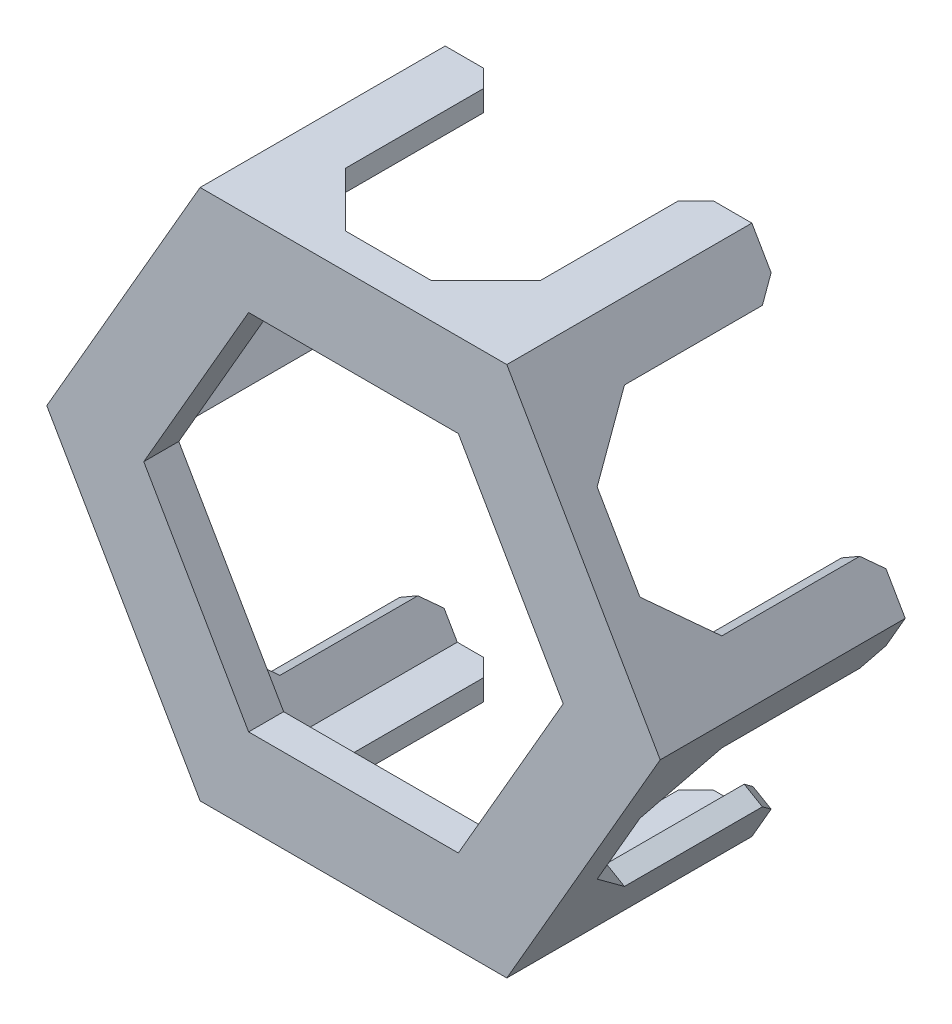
ISO-10303-21;
HEADER;
FILE_DESCRIPTION(('STEP AP214'),'2;1');
FILE_NAME('part.step','',(''),(''),'','','');
FILE_SCHEMA(('AUTOMOTIVE_DESIGN { 1 0 10303 214 1 1 1 1 }'));
ENDSEC;
DATA;
#1=APPLICATION_CONTEXT('core data for automotive mechanical design processes');
#2=APPLICATION_PROTOCOL_DEFINITION('international standard','automotive_design',2000,#1);
#3=PRODUCT_CONTEXT('',#1,'mechanical');
#4=PRODUCT('Part','Part','',(#3));
#5=PRODUCT_RELATED_PRODUCT_CATEGORY('part','',(#4));
#6=PRODUCT_DEFINITION_FORMATION('','',#4);
#7=PRODUCT_DEFINITION_CONTEXT('part definition',#1,'design');
#8=PRODUCT_DEFINITION('design','',#6,#7);
#9=PRODUCT_DEFINITION_SHAPE('','',#8);
#10=(LENGTH_UNIT() NAMED_UNIT(*) SI_UNIT(.MILLI.,.METRE.));
#11=(NAMED_UNIT(*) PLANE_ANGLE_UNIT() SI_UNIT($,.RADIAN.));
#12=(NAMED_UNIT(*) SI_UNIT($,.STERADIAN.) SOLID_ANGLE_UNIT());
#13=UNCERTAINTY_MEASURE_WITH_UNIT(LENGTH_MEASURE(1.E-05),#10,'distance_accuracy_value','');
#14=(GEOMETRIC_REPRESENTATION_CONTEXT(3) GLOBAL_UNCERTAINTY_ASSIGNED_CONTEXT((#13)) GLOBAL_UNIT_ASSIGNED_CONTEXT((#10,
#11,#12)) REPRESENTATION_CONTEXT('',''));
#15=CARTESIAN_POINT('',(0.,0.,0.));
#16=DIRECTION('',(0.,0.,1.));
#17=DIRECTION('',(1.,0.,0.));
#18=AXIS2_PLACEMENT_3D('',#15,#16,#17);
#19=CARTESIAN_POINT('',(0.,0.,0.));
#20=DIRECTION('',(0.,0.,1.));
#21=DIRECTION('',(1.,0.,0.));
#22=AXIS2_PLACEMENT_3D('',#19,#20,#21);
#23=PLANE('',#22);
#24=DIRECTION('',(1.,0.,0.));
#25=VECTOR('',#24,1.);
#26=CARTESIAN_POINT('',(0.,25.9410161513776,0.));
#27=LINE('',#26,#25);
#28=CARTESIAN_POINT('',(-14.9770526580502,25.9410161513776,0.));
#29=VERTEX_POINT('',#28);
#30=CARTESIAN_POINT('',(14.9770526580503,25.9410161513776,0.));
#31=VERTEX_POINT('',#30);
#32=EDGE_CURVE('E674',#29,#31,#27,.T.);
#33=ORIENTED_EDGE('',*,*,#32,.F.);
#34=DIRECTION('',(0.500000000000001,0.866025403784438,0.));
#35=VECTOR('',#34,1.);
#36=CARTESIAN_POINT('',(-22.4655789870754,12.9705080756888,0.));
#37=LINE('',#36,#35);
#38=CARTESIAN_POINT('',(-29.9541053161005,0.,0.));
#39=VERTEX_POINT('',#38);
#40=EDGE_CURVE('E636',#39,#29,#37,.T.);
#41=ORIENTED_EDGE('',*,*,#40,.F.);
#42=DIRECTION('',(-0.499999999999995,0.866025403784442,0.));
#43=VECTOR('',#42,1.);
#44=CARTESIAN_POINT('',(-22.4655789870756,-12.9705080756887,0.));
#45=LINE('',#44,#43);
#46=CARTESIAN_POINT('',(-14.9770526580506,-25.9410161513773,0.));
#47=VERTEX_POINT('',#46);
#48=EDGE_CURVE('E683',#47,#39,#45,.T.);
#49=ORIENTED_EDGE('',*,*,#48,.F.);
#50=DIRECTION('',(-1.,0.,0.));
#51=VECTOR('',#50,1.);
#52=CARTESIAN_POINT('',(0.,-25.9410161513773,0.));
#53=LINE('',#52,#51);
#54=CARTESIAN_POINT('',(14.9770526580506,-25.9410161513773,0.));
#55=VERTEX_POINT('',#54);
#56=EDGE_CURVE('E681',#55,#47,#53,.T.);
#57=ORIENTED_EDGE('',*,*,#56,.F.);
#58=DIRECTION('',(-0.5,-0.866025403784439,0.));
#59=VECTOR('',#58,1.);
#60=CARTESIAN_POINT('',(22.4655789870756,-12.9705080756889,0.));
#61=LINE('',#60,#59);
#62=CARTESIAN_POINT('',(29.9541053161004,-5.15212872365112E-13,0.));
#63=VERTEX_POINT('',#62);
#64=EDGE_CURVE('E679',#63,#55,#61,.T.);
#65=ORIENTED_EDGE('',*,*,#64,.F.);
#66=DIRECTION('',(0.49999999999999,-0.866025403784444,0.));
#67=VECTOR('',#66,1.);
#68=CARTESIAN_POINT('',(22.4655789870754,12.9705080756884,0.));
#69=LINE('',#68,#67);
#70=EDGE_CURVE('E677',#31,#63,#69,.T.);
#71=ORIENTED_EDGE('',*,*,#70,.F.);
#72=EDGE_LOOP('',(#33,#41,#49,#57,#65,#71));
#73=FACE_BOUND('',#72,.T.);
#74=DIRECTION('',(-0.5,-0.866025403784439,0.));
#75=VECTOR('',#74,1.);
#76=CARTESIAN_POINT('',(32.8578838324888,-18.9705080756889,0.));
#77=LINE('',#76,#75);
#78=CARTESIAN_POINT('',(35.9105117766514,-13.6832013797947,0.));
#79=VERTEX_POINT('',#78);
#80=CARTESIAN_POINT('',(29.8052558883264,-24.2578147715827,0.));
#81=VERTEX_POINT('',#80);
#82=EDGE_CURVE('E633',#79,#81,#77,.T.);
#83=ORIENTED_EDGE('',*,*,#82,.T.);
#84=DIRECTION('',(-0.866025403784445,0.49999999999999,0.));
#85=VECTOR('',#84,1.);
#86=CARTESIAN_POINT('',(27.2071796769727,-22.7578147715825,0.));
#87=LINE('',#86,#85);
#88=CARTESIAN_POINT('',(27.2071796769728,-22.7578147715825,0.));
#89=VERTEX_POINT('',#88);
#90=EDGE_CURVE('E856',#81,#89,#87,.T.);
#91=ORIENTED_EDGE('',*,*,#90,.T.);
#92=DIRECTION('',(0.500000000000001,0.866025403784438,0.));
#93=VECTOR('',#92,1.);
#94=CARTESIAN_POINT('',(20.1732050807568,-34.9410161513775,0.));
#95=LINE('',#94,#93);
#96=CARTESIAN_POINT('',(20.1732050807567,-34.9410161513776,0.));
#97=VERTEX_POINT('',#96);
#98=EDGE_CURVE('E467',#97,#89,#95,.T.);
#99=ORIENTED_EDGE('',*,*,#98,.F.);
#100=DIRECTION('',(1.,0.,0.));
#101=VECTOR('',#100,1.);
#102=CARTESIAN_POINT('',(20.1732050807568,-34.9410161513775,0.));
#103=LINE('',#102,#101);
#104=CARTESIAN_POINT('',(6.10525588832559,-34.9410161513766,0.));
#105=VERTEX_POINT('',#104);
#106=EDGE_CURVE('E489',#105,#97,#103,.T.);
#107=ORIENTED_EDGE('',*,*,#106,.F.);
#108=DIRECTION('',(0.,-1.,0.));
#109=VECTOR('',#108,1.);
#110=CARTESIAN_POINT('',(6.10525588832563,-37.9410161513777,0.));
#111=LINE('',#110,#109);
#112=CARTESIAN_POINT('',(6.10525588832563,-37.9410161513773,0.));
#113=VERTEX_POINT('',#112);
#114=EDGE_CURVE('E854',#105,#113,#111,.T.);
#115=ORIENTED_EDGE('',*,*,#114,.T.);
#116=DIRECTION('',(-1.,0.,0.));
#117=VECTOR('',#116,1.);
#118=CARTESIAN_POINT('',(0.,-37.9410161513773,0.));
#119=LINE('',#118,#117);
#120=CARTESIAN_POINT('',(-6.10525588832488,-37.9410161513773,0.));
#121=VERTEX_POINT('',#120);
#122=EDGE_CURVE('E672',#113,#121,#119,.T.);
#123=ORIENTED_EDGE('',*,*,#122,.T.);
#124=DIRECTION('',(0.,1.,0.));
#125=VECTOR('',#124,1.);
#126=CARTESIAN_POINT('',(-6.10525588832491,-34.9410161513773,0.));
#127=LINE('',#126,#125);
#128=CARTESIAN_POINT('',(-6.10525588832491,-34.9410161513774,1.16900234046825E-13));
#129=VERTEX_POINT('',#128);
#130=EDGE_CURVE('E833',#121,#129,#127,.T.);
#131=ORIENTED_EDGE('',*,*,#130,.T.);
#132=DIRECTION('',(1.,0.,0.));
#133=VECTOR('',#132,1.);
#134=CARTESIAN_POINT('',(-20.173205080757,-34.9410161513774,1.78960767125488E-13));
#135=LINE('',#134,#133);
#136=CARTESIAN_POINT('',(-20.1732050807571,-34.9410161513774,0.));
#137=VERTEX_POINT('',#136);
#138=EDGE_CURVE('E507',#137,#129,#135,.T.);
#139=ORIENTED_EDGE('',*,*,#138,.F.);
#140=DIRECTION('',(0.499999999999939,-0.866025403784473,0.));
#141=VECTOR('',#140,1.);
#142=CARTESIAN_POINT('',(-20.173205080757,-34.9410161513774,1.78960767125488E-13));
#143=LINE('',#142,#141);
#144=CARTESIAN_POINT('',(-27.2071796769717,-22.7578147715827,0.));
#145=VERTEX_POINT('',#144);
#146=EDGE_CURVE('E503',#145,#137,#143,.T.);
#147=ORIENTED_EDGE('',*,*,#146,.F.);
#148=DIRECTION('',(-0.866025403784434,-0.500000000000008,0.));
#149=VECTOR('',#148,1.);
#150=CARTESIAN_POINT('',(-29.8052558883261,-24.2578147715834,0.));
#151=LINE('',#150,#149);
#152=CARTESIAN_POINT('',(-29.805255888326,-24.2578147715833,0.));
#153=VERTEX_POINT('',#152);
#154=EDGE_CURVE('E831',#145,#153,#151,.T.);
#155=ORIENTED_EDGE('',*,*,#154,.T.);
#156=DIRECTION('',(-0.499999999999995,0.866025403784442,0.));
#157=VECTOR('',#156,1.);
#158=CARTESIAN_POINT('',(-32.8578838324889,-18.9705080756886,0.));
#159=LINE('',#158,#157);
#160=CARTESIAN_POINT('',(-35.9105117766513,-13.6832013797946,0.));
#161=VERTEX_POINT('',#160);
#162=EDGE_CURVE('E670',#153,#161,#159,.T.);
#163=ORIENTED_EDGE('',*,*,#162,.T.);
#164=DIRECTION('',(0.866025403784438,0.500000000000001,0.));
#165=VECTOR('',#164,1.);
#166=CARTESIAN_POINT('',(-33.3124355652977,-12.1832013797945,0.));
#167=LINE('',#166,#165);
#168=CARTESIAN_POINT('',(-33.3124355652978,-12.1832013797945,1.96818080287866E-13));
#169=VERTEX_POINT('',#168);
#170=EDGE_CURVE('E810',#161,#169,#167,.T.);
#171=ORIENTED_EDGE('',*,*,#170,.T.);
#172=DIRECTION('',(0.499999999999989,-0.866025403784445,0.));
#173=VECTOR('',#172,1.);
#174=CARTESIAN_POINT('',(-40.3464101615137,5.74139260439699E-13,2.37965540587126E-13));
#175=LINE('',#174,#173);
#176=CARTESIAN_POINT('',(-40.3464101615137,5.72458747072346E-13,0.));
#177=VERTEX_POINT('',#176);
#178=EDGE_CURVE('E533',#177,#169,#175,.T.);
#179=ORIENTED_EDGE('',*,*,#178,.F.);
#180=DIRECTION('',(-0.500000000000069,-0.866025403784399,0.));
#181=VECTOR('',#180,1.);
#182=CARTESIAN_POINT('',(-40.3464101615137,5.74139260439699E-13,2.37965540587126E-13));
#183=LINE('',#182,#181);
#184=CARTESIAN_POINT('',(-33.3124355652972,12.1832013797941,0.));
#185=VERTEX_POINT('',#184);
#186=EDGE_CURVE('E529',#185,#177,#183,.T.);
#187=ORIENTED_EDGE('',*,*,#186,.F.);
#188=DIRECTION('',(-0.866025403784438,0.500000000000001,0.));
#189=VECTOR('',#188,1.);
#190=CARTESIAN_POINT('',(-35.9105117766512,13.6832013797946,0.));
#191=LINE('',#190,#189);
#192=CARTESIAN_POINT('',(-35.9105117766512,13.6832013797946,0.));
#193=VERTEX_POINT('',#192);
#194=EDGE_CURVE('E808',#185,#193,#191,.T.);
#195=ORIENTED_EDGE('',*,*,#194,.T.);
#196=DIRECTION('',(0.500000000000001,0.866025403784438,0.));
#197=VECTOR('',#196,1.);
#198=CARTESIAN_POINT('',(-32.8578838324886,18.9705080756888,0.));
#199=LINE('',#198,#197);
#200=CARTESIAN_POINT('',(-29.8052558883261,24.2578147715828,0.));
#201=VERTEX_POINT('',#200);
#202=EDGE_CURVE('E668',#193,#201,#199,.T.);
#203=ORIENTED_EDGE('',*,*,#202,.T.);
#204=DIRECTION('',(0.866025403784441,-0.499999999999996,0.));
#205=VECTOR('',#204,1.);
#206=CARTESIAN_POINT('',(-27.2071796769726,22.7578147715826,0.));
#207=LINE('',#206,#205);
#208=CARTESIAN_POINT('',(-27.2071796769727,22.7578147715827,1.78326886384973E-13));
#209=VERTEX_POINT('',#208);
#210=EDGE_CURVE('E787',#201,#209,#207,.T.);
#211=ORIENTED_EDGE('',*,*,#210,.T.);
#212=DIRECTION('',(-0.500000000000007,-0.866025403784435,0.));
#213=VECTOR('',#212,1.);
#214=CARTESIAN_POINT('',(-20.1732050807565,34.9410161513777,1.779875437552E-13));
#215=LINE('',#214,#213);
#216=CARTESIAN_POINT('',(-20.1732050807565,34.9410161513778,0.));
#217=VERTEX_POINT('',#216);
#218=EDGE_CURVE('E559',#217,#209,#215,.T.);
#219=ORIENTED_EDGE('',*,*,#218,.F.);
#220=DIRECTION('',(-1.,0.,0.));
#221=VECTOR('',#220,1.);
#222=CARTESIAN_POINT('',(-20.1732050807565,34.9410161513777,1.779875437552E-13));
#223=LINE('',#222,#221);
#224=CARTESIAN_POINT('',(-6.10525588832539,34.9410161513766,0.));
#225=VERTEX_POINT('',#224);
#226=EDGE_CURVE('E555',#225,#217,#223,.T.);
#227=ORIENTED_EDGE('',*,*,#226,.F.);
#228=DIRECTION('',(0.,1.,0.));
#229=VECTOR('',#228,1.);
#230=CARTESIAN_POINT('',(-6.1052558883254,37.9410161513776,0.));
#231=LINE('',#230,#229);
#232=CARTESIAN_POINT('',(-6.1052558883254,37.9410161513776,0.));
#233=VERTEX_POINT('',#232);
#234=EDGE_CURVE('E785',#225,#233,#231,.T.);
#235=ORIENTED_EDGE('',*,*,#234,.T.);
#236=DIRECTION('',(1.,0.,0.));
#237=VECTOR('',#236,1.);
#238=CARTESIAN_POINT('',(0.,37.9410161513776,0.));
#239=LINE('',#238,#237);
#240=CARTESIAN_POINT('',(6.1052558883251,37.9410161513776,0.));
#241=VERTEX_POINT('',#240);
#242=EDGE_CURVE('E666',#233,#241,#239,.T.);
#243=ORIENTED_EDGE('',*,*,#242,.T.);
#244=DIRECTION('',(0.,-1.,0.));
#245=VECTOR('',#244,1.);
#246=CARTESIAN_POINT('',(6.10525588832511,34.9410161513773,0.));
#247=LINE('',#246,#245);
#248=CARTESIAN_POINT('',(6.1052558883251,34.9410161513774,0.));
#249=VERTEX_POINT('',#248);
#250=EDGE_CURVE('E764',#241,#249,#247,.T.);
#251=ORIENTED_EDGE('',*,*,#250,.T.);
#252=DIRECTION('',(-1.,0.,0.));
#253=VECTOR('',#252,1.);
#254=CARTESIAN_POINT('',(20.1732050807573,34.9410161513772,0.));
#255=LINE('',#254,#253);
#256=CARTESIAN_POINT('',(20.1732050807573,34.9410161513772,0.));
#257=VERTEX_POINT('',#256);
#258=EDGE_CURVE('E585',#257,#249,#255,.T.);
#259=ORIENTED_EDGE('',*,*,#258,.F.);
#260=DIRECTION('',(-0.499999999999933,0.866025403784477,0.));
#261=VECTOR('',#260,1.);
#262=CARTESIAN_POINT('',(20.1732050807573,34.9410161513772,0.));
#263=LINE('',#262,#261);
#264=CARTESIAN_POINT('',(27.2071796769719,22.7578147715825,0.));
#265=VERTEX_POINT('',#264);
#266=EDGE_CURVE('E581',#265,#257,#263,.T.);
#267=ORIENTED_EDGE('',*,*,#266,.F.);
#268=DIRECTION('',(0.866025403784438,0.500000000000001,0.));
#269=VECTOR('',#268,1.);
#270=CARTESIAN_POINT('',(29.805255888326,24.257814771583,0.));
#271=LINE('',#270,#269);
#272=CARTESIAN_POINT('',(29.8052558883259,24.257814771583,0.));
#273=VERTEX_POINT('',#272);
#274=EDGE_CURVE('E762',#265,#273,#271,.T.);
#275=ORIENTED_EDGE('',*,*,#274,.T.);
#276=DIRECTION('',(0.49999999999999,-0.866025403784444,0.));
#277=VECTOR('',#276,1.);
#278=CARTESIAN_POINT('',(32.8578838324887,18.9705080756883,0.));
#279=LINE('',#278,#277);
#280=CARTESIAN_POINT('',(35.9105117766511,13.6832013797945,0.));
#281=VERTEX_POINT('',#280);
#282=EDGE_CURVE('E664',#273,#281,#279,.T.);
#283=ORIENTED_EDGE('',*,*,#282,.T.);
#284=DIRECTION('',(-0.866025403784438,-0.500000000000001,0.));
#285=VECTOR('',#284,1.);
#286=CARTESIAN_POINT('',(33.3124355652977,12.1832013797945,0.));
#287=LINE('',#286,#285);
#288=CARTESIAN_POINT('',(33.3124355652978,12.1832013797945,0.));
#289=VERTEX_POINT('',#288);
#290=EDGE_CURVE('E723',#281,#289,#287,.T.);
#291=ORIENTED_EDGE('',*,*,#290,.T.);
#292=DIRECTION('',(-0.499999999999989,0.866025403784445,0.));
#293=VECTOR('',#292,1.);
#294=CARTESIAN_POINT('',(40.3464101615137,-5.74139260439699E-13,0.));
#295=LINE('',#294,#293);
#296=CARTESIAN_POINT('',(40.3464101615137,-5.74139260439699E-13,0.));
#297=VERTEX_POINT('',#296);
#298=EDGE_CURVE('E611',#297,#289,#295,.T.);
#299=ORIENTED_EDGE('',*,*,#298,.F.);
#300=DIRECTION('',(0.500000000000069,0.866025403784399,0.));
#301=VECTOR('',#300,1.);
#302=CARTESIAN_POINT('',(40.3464101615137,-5.74139260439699E-13,0.));
#303=LINE('',#302,#301);
#304=CARTESIAN_POINT('',(33.3124355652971,-12.1832013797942,0.));
#305=VERTEX_POINT('',#304);
#306=EDGE_CURVE('E607',#305,#297,#303,.T.);
#307=ORIENTED_EDGE('',*,*,#306,.F.);
#308=DIRECTION('',(0.866025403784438,-0.500000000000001,0.));
#309=VECTOR('',#308,1.);
#310=CARTESIAN_POINT('',(35.9105117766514,-13.6832013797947,0.));
#311=LINE('',#310,#309);
#312=EDGE_CURVE('E721',#305,#79,#311,.T.);
#313=ORIENTED_EDGE('',*,*,#312,.T.);
#314=EDGE_LOOP('',(#83,#91,#99,#107,#115,#123,#131,#139,#147,#155,#163,#171,#179,#187,#195,#203,
#211,#219,#227,#235,#243,#251,#259,#267,#275,#283,#291,#299,#307,#313));
#315=FACE_BOUND('',#314,.T.);
#316=ADVANCED_FACE('F43',(#73,#315),#23,.F.);
#317=CARTESIAN_POINT('',(0.,25.9410161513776,5.));
#318=DIRECTION('',(0.,1.,0.));
#319=DIRECTION('',(-1.,0.,0.));
#320=AXIS2_PLACEMENT_3D('',#317,#318,#319);
#321=PLANE('',#320);
#322=ORIENTED_EDGE('',*,*,#32,.T.);
#323=DIRECTION('',(0.,0.,-1.));
#324=VECTOR('',#323,1.);
#325=CARTESIAN_POINT('',(14.9770526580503,25.9410161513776,5.));
#326=LINE('',#325,#324);
#327=CARTESIAN_POINT('',(14.9770526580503,25.9410161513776,5.));
#328=VERTEX_POINT('',#327);
#329=EDGE_CURVE('E702',#328,#31,#326,.T.);
#330=ORIENTED_EDGE('',*,*,#329,.F.);
#331=DIRECTION('',(1.,0.,0.));
#332=VECTOR('',#331,1.);
#333=CARTESIAN_POINT('',(0.,25.9410161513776,5.));
#334=LINE('',#333,#332);
#335=CARTESIAN_POINT('',(-14.9770526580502,25.9410161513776,5.));
#336=VERTEX_POINT('',#335);
#337=EDGE_CURVE('E650',#336,#328,#334,.T.);
#338=ORIENTED_EDGE('',*,*,#337,.F.);
#339=DIRECTION('',(0.,0.,-1.));
#340=VECTOR('',#339,1.);
#341=CARTESIAN_POINT('',(-14.9770526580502,25.9410161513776,5.));
#342=LINE('',#341,#340);
#343=EDGE_CURVE('E686',#336,#29,#342,.T.);
#344=ORIENTED_EDGE('',*,*,#343,.T.);
#345=EDGE_LOOP('',(#322,#330,#338,#344));
#346=FACE_BOUND('',#345,.T.);
#347=ADVANCED_FACE('F1209',(#346),#321,.F.);
#348=CARTESIAN_POINT('',(22.4655789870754,12.9705080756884,5.));
#349=DIRECTION('',(0.866025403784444,0.49999999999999,0.));
#350=DIRECTION('',(-0.49999999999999,0.866025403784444,0.));
#351=AXIS2_PLACEMENT_3D('',#348,#349,#350);
#352=PLANE('',#351);
#353=ORIENTED_EDGE('',*,*,#70,.T.);
#354=DIRECTION('',(0.,0.,-1.));
#355=VECTOR('',#354,1.);
#356=CARTESIAN_POINT('',(29.9541053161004,-5.15212872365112E-13,5.));
#357=LINE('',#356,#355);
#358=CARTESIAN_POINT('',(29.9541053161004,-5.15212872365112E-13,5.));
#359=VERTEX_POINT('',#358);
#360=EDGE_CURVE('E699',#359,#63,#357,.T.);
#361=ORIENTED_EDGE('',*,*,#360,.F.);
#362=DIRECTION('',(0.49999999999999,-0.866025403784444,0.));
#363=VECTOR('',#362,1.);
#364=CARTESIAN_POINT('',(22.4655789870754,12.9705080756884,5.));
#365=LINE('',#364,#363);
#366=EDGE_CURVE('E653',#328,#359,#365,.T.);
#367=ORIENTED_EDGE('',*,*,#366,.F.);
#368=ORIENTED_EDGE('',*,*,#329,.T.);
#369=EDGE_LOOP('',(#353,#361,#367,#368));
#370=FACE_BOUND('',#369,.T.);
#371=ADVANCED_FACE('F1215',(#370),#352,.F.);
#372=CARTESIAN_POINT('',(22.4655789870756,-12.9705080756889,5.));
#373=DIRECTION('',(0.866025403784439,-0.5,0.));
#374=DIRECTION('',(0.5,0.866025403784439,0.));
#375=AXIS2_PLACEMENT_3D('',#372,#373,#374);
#376=PLANE('',#375);
#377=ORIENTED_EDGE('',*,*,#64,.T.);
#378=DIRECTION('',(0.,0.,-1.));
#379=VECTOR('',#378,1.);
#380=CARTESIAN_POINT('',(14.9770526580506,-25.9410161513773,5.));
#381=LINE('',#380,#379);
#382=CARTESIAN_POINT('',(14.9770526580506,-25.9410161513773,5.));
#383=VERTEX_POINT('',#382);
#384=EDGE_CURVE('E696',#383,#55,#381,.T.);
#385=ORIENTED_EDGE('',*,*,#384,.F.);
#386=DIRECTION('',(-0.5,-0.866025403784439,0.));
#387=VECTOR('',#386,1.);
#388=CARTESIAN_POINT('',(22.4655789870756,-12.9705080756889,5.));
#389=LINE('',#388,#387);
#390=EDGE_CURVE('E655',#359,#383,#389,.T.);
#391=ORIENTED_EDGE('',*,*,#390,.F.);
#392=ORIENTED_EDGE('',*,*,#360,.T.);
#393=EDGE_LOOP('',(#377,#385,#391,#392));
#394=FACE_BOUND('',#393,.T.);
#395=ADVANCED_FACE('F1234',(#394),#376,.F.);
#396=CARTESIAN_POINT('',(0.,-25.9410161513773,5.));
#397=DIRECTION('',(0.,-1.,0.));
#398=DIRECTION('',(1.,0.,0.));
#399=AXIS2_PLACEMENT_3D('',#396,#397,#398);
#400=PLANE('',#399);
#401=ORIENTED_EDGE('',*,*,#56,.T.);
#402=DIRECTION('',(0.,0.,-1.));
#403=VECTOR('',#402,1.);
#404=CARTESIAN_POINT('',(-14.9770526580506,-25.9410161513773,5.));
#405=LINE('',#404,#403);
#406=CARTESIAN_POINT('',(-14.9770526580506,-25.9410161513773,5.));
#407=VERTEX_POINT('',#406);
#408=EDGE_CURVE('E693',#407,#47,#405,.T.);
#409=ORIENTED_EDGE('',*,*,#408,.F.);
#410=DIRECTION('',(-1.,0.,0.));
#411=VECTOR('',#410,1.);
#412=CARTESIAN_POINT('',(0.,-25.9410161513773,5.));
#413=LINE('',#412,#411);
#414=EDGE_CURVE('E657',#383,#407,#413,.T.);
#415=ORIENTED_EDGE('',*,*,#414,.F.);
#416=ORIENTED_EDGE('',*,*,#384,.T.);
#417=EDGE_LOOP('',(#401,#409,#415,#416));
#418=FACE_BOUND('',#417,.T.);
#419=ADVANCED_FACE('F1230',(#418),#400,.F.);
#420=CARTESIAN_POINT('',(-22.4655789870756,-12.9705080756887,5.));
#421=DIRECTION('',(-0.866025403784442,-0.499999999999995,0.));
#422=DIRECTION('',(0.499999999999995,-0.866025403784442,0.));
#423=AXIS2_PLACEMENT_3D('',#420,#421,#422);
#424=PLANE('',#423);
#425=ORIENTED_EDGE('',*,*,#48,.T.);
#426=DIRECTION('',(0.,0.,-1.));
#427=VECTOR('',#426,1.);
#428=CARTESIAN_POINT('',(-29.9541053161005,0.,5.));
#429=LINE('',#428,#427);
#430=CARTESIAN_POINT('',(-29.9541053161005,0.,5.));
#431=VERTEX_POINT('',#430);
#432=EDGE_CURVE('E689',#431,#39,#429,.T.);
#433=ORIENTED_EDGE('',*,*,#432,.F.);
#434=DIRECTION('',(-0.499999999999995,0.866025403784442,0.));
#435=VECTOR('',#434,1.);
#436=CARTESIAN_POINT('',(-22.4655789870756,-12.9705080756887,5.));
#437=LINE('',#436,#435);
#438=EDGE_CURVE('E659',#407,#431,#437,.T.);
#439=ORIENTED_EDGE('',*,*,#438,.F.);
#440=ORIENTED_EDGE('',*,*,#408,.T.);
#441=EDGE_LOOP('',(#425,#433,#439,#440));
#442=FACE_BOUND('',#441,.T.);
#443=ADVANCED_FACE('F1227',(#442),#424,.F.);
#444=CARTESIAN_POINT('',(32.8578838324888,-18.9705080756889,5.));
#445=DIRECTION('',(0.866025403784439,-0.5,0.));
#446=DIRECTION('',(0.5,0.866025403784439,0.));
#447=AXIS2_PLACEMENT_3D('',#444,#445,#446);
#448=PLANE('',#447);
#449=DIRECTION('',(-0.500000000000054,-0.866025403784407,0.));
#450=VECTOR('',#449,1.);
#451=CARTESIAN_POINT('',(21.9052558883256,-37.9410161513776,-29.9999999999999));
#452=LINE('',#451,#450);
#453=CARTESIAN_POINT('',(24.6552558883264,-33.1778764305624,-30.));
#454=VERTEX_POINT('',#453);
#455=CARTESIAN_POINT('',(21.9052558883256,-37.9410161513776,-29.9999999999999));
#456=VERTEX_POINT('',#455);
#457=EDGE_CURVE('E456',#454,#456,#452,.T.);
#458=ORIENTED_EDGE('',*,*,#457,.F.);
#459=DIRECTION('',(-0.353553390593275,-0.612372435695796,-0.707106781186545));
#460=VECTOR('',#459,1.);
#461=CARTESIAN_POINT('',(37.5065698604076,-10.918747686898,-4.29737205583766));
#462=LINE('',#461,#460);
#463=CARTESIAN_POINT('',(25.9052558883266,-31.0128129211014,-27.5));
#464=VERTEX_POINT('',#463);
#465=EDGE_CURVE('E948',#454,#464,#462,.F.);
#466=ORIENTED_EDGE('',*,*,#465,.T.);
#467=DIRECTION('',(0.,0.,1.));
#468=VECTOR('',#467,1.);
#469=CARTESIAN_POINT('',(25.9052558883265,-31.0128129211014,-30.));
#470=LINE('',#469,#468);
#471=CARTESIAN_POINT('',(25.9052558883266,-31.0128129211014,-7.79999999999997));
#472=VERTEX_POINT('',#471);
#473=EDGE_CURVE('E488',#464,#472,#470,.T.);
#474=ORIENTED_EDGE('',*,*,#473,.T.);
#475=DIRECTION('',(-0.353553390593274,-0.612372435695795,-0.707106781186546));
#476=VECTOR('',#475,1.);
#477=CARTESIAN_POINT('',(25.9052558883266,-31.0128129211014,-7.79999999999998));
#478=LINE('',#477,#476);
#479=EDGE_CURVE('E862',#472,#81,#478,.F.);
#480=ORIENTED_EDGE('',*,*,#479,.T.);
#481=ORIENTED_EDGE('',*,*,#82,.F.);
#482=DIRECTION('',(-0.353553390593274,-0.612372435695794,0.707106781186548));
#483=VECTOR('',#482,1.);
#484=CARTESIAN_POINT('',(39.8105117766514,-6.92820323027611,-7.8));
#485=LINE('',#484,#483);
#486=CARTESIAN_POINT('',(39.8105117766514,-6.92820323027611,-7.8));
#487=VERTEX_POINT('',#486);
#488=EDGE_CURVE('E738',#79,#487,#485,.F.);
#489=ORIENTED_EDGE('',*,*,#488,.T.);
#490=DIRECTION('',(0.,0.,1.));
#491=VECTOR('',#490,1.);
#492=CARTESIAN_POINT('',(39.8105117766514,-6.92820323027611,-30.));
#493=LINE('',#492,#491);
#494=CARTESIAN_POINT('',(39.8105117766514,-6.92820323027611,-27.5));
#495=VERTEX_POINT('',#494);
#496=EDGE_CURVE('E631',#495,#487,#493,.T.);
#497=ORIENTED_EDGE('',*,*,#496,.F.);
#498=DIRECTION('',(-0.353553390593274,-0.612372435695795,0.707106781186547));
#499=VECTOR('',#498,1.);
#500=CARTESIAN_POINT('',(28.2091978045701,-27.0222684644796,-4.29737205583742));
#501=LINE('',#500,#499);
#502=CARTESIAN_POINT('',(41.0605117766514,-4.76313972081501,-30.));
#503=VERTEX_POINT('',#502);
#504=EDGE_CURVE('E757',#495,#503,#501,.F.);
#505=ORIENTED_EDGE('',*,*,#504,.T.);
#506=DIRECTION('',(-0.5,-0.866025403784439,0.));
#507=VECTOR('',#506,1.);
#508=CARTESIAN_POINT('',(43.8105117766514,-5.97503817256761E-13,-30.));
#509=LINE('',#508,#507);
#510=CARTESIAN_POINT('',(43.8105117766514,-5.97503817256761E-13,-30.));
#511=VERTEX_POINT('',#510);
#512=EDGE_CURVE('E610',#511,#503,#509,.T.);
#513=ORIENTED_EDGE('',*,*,#512,.F.);
#514=DIRECTION('',(0.,0.,-1.));
#515=VECTOR('',#514,1.);
#516=CARTESIAN_POINT('',(43.8105117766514,-6.00214322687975E-13,5.));
#517=LINE('',#516,#515);
#518=CARTESIAN_POINT('',(43.8105117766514,-6.00214322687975E-13,5.));
#519=VERTEX_POINT('',#518);
#520=EDGE_CURVE('E690',#519,#511,#517,.T.);
#521=ORIENTED_EDGE('',*,*,#520,.F.);
#522=DIRECTION('',(-0.5,-0.866025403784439,0.));
#523=VECTOR('',#522,1.);
#524=CARTESIAN_POINT('',(32.8578838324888,-18.9705080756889,5.));
#525=LINE('',#524,#523);
#526=CARTESIAN_POINT('',(21.9052558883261,-37.9410161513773,5.));
#527=VERTEX_POINT('',#526);
#528=EDGE_CURVE('E473',#519,#527,#525,.T.);
#529=ORIENTED_EDGE('',*,*,#528,.T.);
#530=DIRECTION('',(0.,0.,-1.));
#531=VECTOR('',#530,1.);
#532=CARTESIAN_POINT('',(21.9052558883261,-37.9410161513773,5.));
#533=LINE('',#532,#531);
#534=EDGE_CURVE('E470',#527,#456,#533,.T.);
#535=ORIENTED_EDGE('',*,*,#534,.T.);
#536=EDGE_LOOP('',(#458,#466,#474,#480,#481,#489,#497,#505,#513,#521,#529,#535));
#537=FACE_BOUND('',#536,.T.);
#538=ADVANCED_FACE('F471',(#537),#448,.T.);
#539=CARTESIAN_POINT('',(32.8578838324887,18.9705080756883,5.));
#540=DIRECTION('',(0.866025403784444,0.49999999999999,0.));
#541=DIRECTION('',(-0.49999999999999,0.866025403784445,0.));
#542=AXIS2_PLACEMENT_3D('',#539,#540,#541);
#543=PLANE('',#542);
#544=DIRECTION('',(0.,0.,1.));
#545=VECTOR('',#544,1.);
#546=CARTESIAN_POINT('',(25.9052558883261,31.0128129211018,-30.));
#547=LINE('',#546,#545);
#548=CARTESIAN_POINT('',(25.9052558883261,31.0128129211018,-27.5));
#549=VERTEX_POINT('',#548);
#550=CARTESIAN_POINT('',(25.9052558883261,31.0128129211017,-7.79999999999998));
#551=VERTEX_POINT('',#550);
#552=EDGE_CURVE('E605',#549,#551,#547,.T.);
#553=ORIENTED_EDGE('',*,*,#552,.F.);
#554=DIRECTION('',(0.353553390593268,-0.6123724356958,0.707106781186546));
#555=VECTOR('',#554,1.);
#556=CARTESIAN_POINT('',(37.5065698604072,10.9187476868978,-4.29737205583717));
#557=LINE('',#556,#555);
#558=CARTESIAN_POINT('',(24.6552558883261,33.1778764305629,-30.));
#559=VERTEX_POINT('',#558);
#560=EDGE_CURVE('E889',#549,#559,#557,.F.);
#561=ORIENTED_EDGE('',*,*,#560,.T.);
#562=DIRECTION('',(0.500000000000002,-0.866025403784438,0.));
#563=VECTOR('',#562,1.);
#564=CARTESIAN_POINT('',(21.9052558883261,37.9410161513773,-29.9999999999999));
#565=LINE('',#564,#563);
#566=CARTESIAN_POINT('',(21.9052558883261,37.9410161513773,-29.9999999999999));
#567=VERTEX_POINT('',#566);
#568=EDGE_CURVE('E584',#567,#559,#565,.T.);
#569=ORIENTED_EDGE('',*,*,#568,.F.);
#570=DIRECTION('',(0.,0.,-1.));
#571=VECTOR('',#570,1.);
#572=CARTESIAN_POINT('',(21.9052558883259,37.9410161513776,5.));
#573=LINE('',#572,#571);
#574=CARTESIAN_POINT('',(21.9052558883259,37.9410161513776,5.));
#575=VERTEX_POINT('',#574);
#576=EDGE_CURVE('E714',#575,#567,#573,.T.);
#577=ORIENTED_EDGE('',*,*,#576,.F.);
#578=DIRECTION('',(0.49999999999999,-0.866025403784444,0.));
#579=VECTOR('',#578,1.);
#580=CARTESIAN_POINT('',(32.8578838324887,18.9705080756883,5.));
#581=LINE('',#580,#579);
#582=EDGE_CURVE('E635',#575,#519,#581,.T.);
#583=ORIENTED_EDGE('',*,*,#582,.T.);
#584=ORIENTED_EDGE('',*,*,#520,.T.);
#585=DIRECTION('',(0.499999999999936,-0.866025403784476,0.));
#586=VECTOR('',#585,1.);
#587=CARTESIAN_POINT('',(43.8105117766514,-5.97503817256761E-13,-30.));
#588=LINE('',#587,#586);
#589=CARTESIAN_POINT('',(41.0605117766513,4.76313972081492,-30.));
#590=VERTEX_POINT('',#589);
#591=EDGE_CURVE('E608',#590,#511,#588,.T.);
#592=ORIENTED_EDGE('',*,*,#591,.F.);
#593=DIRECTION('',(0.353553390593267,-0.612372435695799,-0.707106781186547));
#594=VECTOR('',#593,1.);
#595=CARTESIAN_POINT('',(28.20919780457,27.0222684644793,-4.29737205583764));
#596=LINE('',#595,#594);
#597=CARTESIAN_POINT('',(39.8105117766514,6.92820323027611,-27.5));
#598=VERTEX_POINT('',#597);
#599=EDGE_CURVE('E747',#590,#598,#596,.F.);
#600=ORIENTED_EDGE('',*,*,#599,.T.);
#601=DIRECTION('',(0.,0.,1.));
#602=VECTOR('',#601,1.);
#603=CARTESIAN_POINT('',(39.8105117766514,6.92820323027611,-30.));
#604=LINE('',#603,#602);
#605=CARTESIAN_POINT('',(39.8105117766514,6.92820323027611,-7.8));
#606=VERTEX_POINT('',#605);
#607=EDGE_CURVE('E619',#598,#606,#604,.T.);
#608=ORIENTED_EDGE('',*,*,#607,.T.);
#609=DIRECTION('',(0.353553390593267,-0.612372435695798,-0.707106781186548));
#610=VECTOR('',#609,1.);
#611=CARTESIAN_POINT('',(39.8105117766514,6.92820323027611,-7.8));
#612=LINE('',#611,#610);
#613=EDGE_CURVE('E729',#606,#281,#612,.F.);
#614=ORIENTED_EDGE('',*,*,#613,.T.);
#615=ORIENTED_EDGE('',*,*,#282,.F.);
#616=DIRECTION('',(0.353553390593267,-0.6123724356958,0.707106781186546));
#617=VECTOR('',#616,1.);
#618=CARTESIAN_POINT('',(25.9052558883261,31.0128129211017,-7.79999999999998));
#619=LINE('',#618,#617);
#620=EDGE_CURVE('E779',#273,#551,#619,.F.);
#621=ORIENTED_EDGE('',*,*,#620,.T.);
#622=EDGE_LOOP('',(#553,#561,#569,#577,#583,#584,#592,#600,#608,#614,#615,#621));
#623=FACE_BOUND('',#622,.T.);
#624=ADVANCED_FACE('F1008',(#623),#543,.T.);
#625=CARTESIAN_POINT('',(0.,37.9410161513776,5.));
#626=DIRECTION('',(0.,1.,0.));
#627=DIRECTION('',(0.,0.,1.));
#628=AXIS2_PLACEMENT_3D('',#625,#626,#627);
#629=PLANE('',#628);
#630=DIRECTION('',(0.,0.,1.));
#631=VECTOR('',#630,1.);
#632=CARTESIAN_POINT('',(-13.9052558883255,37.9410161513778,-29.9999999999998));
#633=LINE('',#632,#631);
#634=CARTESIAN_POINT('',(-13.9052558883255,37.9410161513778,-27.4999999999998));
#635=VERTEX_POINT('',#634);
#636=CARTESIAN_POINT('',(-13.9052558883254,37.9410161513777,-7.79999999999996));
#637=VERTEX_POINT('',#636);
#638=EDGE_CURVE('E579',#635,#637,#633,.T.);
#639=ORIENTED_EDGE('',*,*,#638,.F.);
#640=DIRECTION('',(0.70710678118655,0.,0.707106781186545));
#641=VECTOR('',#640,1.);
#642=CARTESIAN_POINT('',(9.29737205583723,37.9410161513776,-4.2973720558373));
#643=LINE('',#642,#641);
#644=CARTESIAN_POINT('',(-16.4052558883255,37.9410161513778,-29.9999999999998));
#645=VERTEX_POINT('',#644);
#646=EDGE_CURVE('E907',#635,#645,#643,.F.);
#647=ORIENTED_EDGE('',*,*,#646,.T.);
#648=DIRECTION('',(1.,0.,0.));
#649=VECTOR('',#648,1.);
#650=CARTESIAN_POINT('',(-21.9052558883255,37.9410161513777,-29.9999999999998));
#651=LINE('',#650,#649);
#652=CARTESIAN_POINT('',(-21.9052558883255,37.9410161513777,-29.9999999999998));
#653=VERTEX_POINT('',#652);
#654=EDGE_CURVE('E558',#653,#645,#651,.T.);
#655=ORIENTED_EDGE('',*,*,#654,.F.);
#656=DIRECTION('',(0.,0.,-1.));
#657=VECTOR('',#656,1.);
#658=CARTESIAN_POINT('',(-21.9052558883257,37.9410161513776,5.));
#659=LINE('',#658,#657);
#660=CARTESIAN_POINT('',(-21.9052558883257,37.9410161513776,5.));
#661=VERTEX_POINT('',#660);
#662=EDGE_CURVE('E711',#661,#653,#659,.T.);
#663=ORIENTED_EDGE('',*,*,#662,.F.);
#664=DIRECTION('',(1.,0.,0.));
#665=VECTOR('',#664,1.);
#666=CARTESIAN_POINT('',(0.,37.9410161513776,5.));
#667=LINE('',#666,#665);
#668=EDGE_CURVE('E639',#661,#575,#667,.T.);
#669=ORIENTED_EDGE('',*,*,#668,.T.);
#670=ORIENTED_EDGE('',*,*,#576,.T.);
#671=DIRECTION('',(1.,0.,0.));
#672=VECTOR('',#671,1.);
#673=CARTESIAN_POINT('',(21.9052558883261,37.9410161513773,-29.9999999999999));
#674=LINE('',#673,#672);
#675=CARTESIAN_POINT('',(16.4052558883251,37.9410161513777,-29.9999999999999));
#676=VERTEX_POINT('',#675);
#677=EDGE_CURVE('E582',#676,#567,#674,.T.);
#678=ORIENTED_EDGE('',*,*,#677,.F.);
#679=DIRECTION('',(0.707106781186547,0.,-0.707106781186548));
#680=VECTOR('',#679,1.);
#681=CARTESIAN_POINT('',(-9.29737205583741,37.9410161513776,-4.29737205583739));
#682=LINE('',#681,#680);
#683=CARTESIAN_POINT('',(13.9052558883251,37.9410161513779,-27.4999999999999));
#684=VERTEX_POINT('',#683);
#685=EDGE_CURVE('E879',#676,#684,#682,.F.);
#686=ORIENTED_EDGE('',*,*,#685,.T.);
#687=DIRECTION('',(0.,0.,1.));
#688=VECTOR('',#687,1.);
#689=CARTESIAN_POINT('',(13.9052558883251,37.9410161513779,-29.9999999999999));
#690=LINE('',#689,#688);
#691=CARTESIAN_POINT('',(13.9052558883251,37.9410161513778,-7.80000000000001));
#692=VERTEX_POINT('',#691);
#693=EDGE_CURVE('E593',#684,#692,#690,.T.);
#694=ORIENTED_EDGE('',*,*,#693,.T.);
#695=DIRECTION('',(0.707106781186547,0.,-0.707106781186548));
#696=VECTOR('',#695,1.);
#697=CARTESIAN_POINT('',(13.9052558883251,37.9410161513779,-7.80000000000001));
#698=LINE('',#697,#696);
#699=EDGE_CURVE('E770',#692,#241,#698,.F.);
#700=ORIENTED_EDGE('',*,*,#699,.T.);
#701=ORIENTED_EDGE('',*,*,#242,.F.);
#702=DIRECTION('',(0.707106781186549,0.,0.707106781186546));
#703=VECTOR('',#702,1.);
#704=CARTESIAN_POINT('',(-13.9052558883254,37.9410161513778,-7.79999999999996));
#705=LINE('',#704,#703);
#706=EDGE_CURVE('E802',#233,#637,#705,.F.);
#707=ORIENTED_EDGE('',*,*,#706,.T.);
#708=EDGE_LOOP('',(#639,#647,#655,#663,#669,#670,#678,#686,#694,#700,#701,#707));
#709=FACE_BOUND('',#708,.T.);
#710=ADVANCED_FACE('F1052',(#709),#629,.T.);
#711=CARTESIAN_POINT('',(-32.8578838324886,18.9705080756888,5.));
#712=DIRECTION('',(-0.866025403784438,0.500000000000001,0.));
#713=DIRECTION('',(-0.500000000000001,-0.866025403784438,0.));
#714=AXIS2_PLACEMENT_3D('',#711,#712,#713);
#715=PLANE('',#714);
#716=DIRECTION('',(0.,0.,1.));
#717=VECTOR('',#716,1.);
#718=CARTESIAN_POINT('',(-39.8105117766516,6.92820323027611,-29.9999999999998));
#719=LINE('',#718,#717);
#720=CARTESIAN_POINT('',(-39.8105117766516,6.92820323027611,-27.4999999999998));
#721=VERTEX_POINT('',#720);
#722=CARTESIAN_POINT('',(-39.8105117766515,6.92820323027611,-7.79999999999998));
#723=VERTEX_POINT('',#722);
#724=EDGE_CURVE('E553',#721,#723,#719,.T.);
#725=ORIENTED_EDGE('',*,*,#724,.F.);
#726=DIRECTION('',(0.353553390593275,0.612372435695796,0.707106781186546));
#727=VECTOR('',#726,1.);
#728=CARTESIAN_POINT('',(-28.20919780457,27.0222684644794,-4.2973720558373));
#729=LINE('',#728,#727);
#730=CARTESIAN_POINT('',(-41.0605117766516,4.76313972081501,-29.9999999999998));
#731=VERTEX_POINT('',#730);
#732=EDGE_CURVE('E925',#721,#731,#729,.F.);
#733=ORIENTED_EDGE('',*,*,#732,.T.);
#734=DIRECTION('',(0.5,0.866025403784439,0.));
#735=VECTOR('',#734,1.);
#736=CARTESIAN_POINT('',(-43.8105117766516,5.96668217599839E-13,-29.9999999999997));
#737=LINE('',#736,#735);
#738=CARTESIAN_POINT('',(-43.8105117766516,5.96668217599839E-13,-29.9999999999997));
#739=VERTEX_POINT('',#738);
#740=EDGE_CURVE('E532',#739,#731,#737,.T.);
#741=ORIENTED_EDGE('',*,*,#740,.F.);
#742=DIRECTION('',(0.,0.,-1.));
#743=VECTOR('',#742,1.);
#744=CARTESIAN_POINT('',(-43.8105117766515,0.,5.));
#745=LINE('',#744,#743);
#746=CARTESIAN_POINT('',(-43.8105117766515,0.,5.));
#747=VERTEX_POINT('',#746);
#748=EDGE_CURVE('E708',#747,#739,#745,.T.);
#749=ORIENTED_EDGE('',*,*,#748,.F.);
#750=DIRECTION('',(0.500000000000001,0.866025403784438,0.));
#751=VECTOR('',#750,1.);
#752=CARTESIAN_POINT('',(-32.8578838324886,18.9705080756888,5.));
#753=LINE('',#752,#751);
#754=EDGE_CURVE('E642',#747,#661,#753,.T.);
#755=ORIENTED_EDGE('',*,*,#754,.T.);
#756=ORIENTED_EDGE('',*,*,#662,.T.);
#757=DIRECTION('',(0.500000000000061,0.866025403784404,0.));
#758=VECTOR('',#757,1.);
#759=CARTESIAN_POINT('',(-21.9052558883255,37.9410161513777,-29.9999999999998));
#760=LINE('',#759,#758);
#761=CARTESIAN_POINT('',(-24.6552558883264,33.1778764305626,-29.9999999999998));
#762=VERTEX_POINT('',#761);
#763=EDGE_CURVE('E556',#762,#653,#760,.T.);
#764=ORIENTED_EDGE('',*,*,#763,.F.);
#765=DIRECTION('',(0.353553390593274,0.612372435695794,-0.707106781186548));
#766=VECTOR('',#765,1.);
#767=CARTESIAN_POINT('',(-37.5065698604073,10.9187476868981,-4.29737205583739));
#768=LINE('',#767,#766);
#769=CARTESIAN_POINT('',(-25.9052558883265,31.0128129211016,-27.4999999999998));
#770=VERTEX_POINT('',#769);
#771=EDGE_CURVE('E897',#762,#770,#768,.F.);
#772=ORIENTED_EDGE('',*,*,#771,.T.);
#773=DIRECTION('',(0.,0.,1.));
#774=VECTOR('',#773,1.);
#775=CARTESIAN_POINT('',(-25.9052558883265,31.0128129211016,-29.9999999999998));
#776=LINE('',#775,#774);
#777=CARTESIAN_POINT('',(-25.9052558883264,31.0128129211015,-7.8));
#778=VERTEX_POINT('',#777);
#779=EDGE_CURVE('E567',#770,#778,#776,.T.);
#780=ORIENTED_EDGE('',*,*,#779,.T.);
#781=DIRECTION('',(0.353553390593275,0.612372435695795,-0.707106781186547));
#782=VECTOR('',#781,1.);
#783=CARTESIAN_POINT('',(-25.9052558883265,31.0128129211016,-7.8));
#784=LINE('',#783,#782);
#785=EDGE_CURVE('E793',#778,#201,#784,.F.);
#786=ORIENTED_EDGE('',*,*,#785,.T.);
#787=ORIENTED_EDGE('',*,*,#202,.F.);
#788=DIRECTION('',(0.353553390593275,0.612372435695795,0.707106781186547));
#789=VECTOR('',#788,1.);
#790=CARTESIAN_POINT('',(-39.8105117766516,6.92820323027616,-7.79999999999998));
#791=LINE('',#790,#789);
#792=EDGE_CURVE('E825',#193,#723,#791,.F.);
#793=ORIENTED_EDGE('',*,*,#792,.T.);
#794=EDGE_LOOP('',(#725,#733,#741,#749,#755,#756,#764,#772,#780,#786,#787,#793));
#795=FACE_BOUND('',#794,.T.);
#796=ADVANCED_FACE('F1096',(#795),#715,.T.);
#797=CARTESIAN_POINT('',(-32.8578838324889,-18.9705080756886,5.));
#798=DIRECTION('',(-0.866025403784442,-0.499999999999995,0.));
#799=DIRECTION('',(0.499999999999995,-0.866025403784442,0.));
#800=AXIS2_PLACEMENT_3D('',#797,#798,#799);
#801=PLANE('',#800);
#802=DIRECTION('',(0.,0.,1.));
#803=VECTOR('',#802,1.);
#804=CARTESIAN_POINT('',(-25.9052558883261,-31.012812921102,-29.9999999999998));
#805=LINE('',#804,#803);
#806=CARTESIAN_POINT('',(-25.9052558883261,-31.012812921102,-27.4999999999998));
#807=VERTEX_POINT('',#806);
#808=CARTESIAN_POINT('',(-25.905255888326,-31.0128129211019,-7.8));
#809=VERTEX_POINT('',#808);
#810=EDGE_CURVE('E527',#807,#809,#805,.T.);
#811=ORIENTED_EDGE('',*,*,#810,.F.);
#812=DIRECTION('',(-0.35355339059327,0.612372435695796,0.707106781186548));
#813=VECTOR('',#812,1.);
#814=CARTESIAN_POINT('',(-37.5065698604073,-10.9187476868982,-4.297372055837));
#815=LINE('',#814,#813);
#816=CARTESIAN_POINT('',(-24.6552558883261,-33.177876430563,-29.9999999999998));
#817=VERTEX_POINT('',#816);
#818=EDGE_CURVE('E943',#807,#817,#815,.F.);
#819=ORIENTED_EDGE('',*,*,#818,.T.);
#820=DIRECTION('',(-0.500000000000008,0.866025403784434,0.));
#821=VECTOR('',#820,1.);
#822=CARTESIAN_POINT('',(-21.905255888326,-37.9410161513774,-29.9999999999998));
#823=LINE('',#822,#821);
#824=CARTESIAN_POINT('',(-21.905255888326,-37.9410161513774,-29.9999999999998));
#825=VERTEX_POINT('',#824);
#826=EDGE_CURVE('E506',#825,#817,#823,.T.);
#827=ORIENTED_EDGE('',*,*,#826,.F.);
#828=DIRECTION('',(0.,0.,-1.));
#829=VECTOR('',#828,1.);
#830=CARTESIAN_POINT('',(-21.9052558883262,-37.9410161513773,5.));
#831=LINE('',#830,#829);
#832=CARTESIAN_POINT('',(-21.9052558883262,-37.9410161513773,5.));
#833=VERTEX_POINT('',#832);
#834=EDGE_CURVE('E477',#833,#825,#831,.T.);
#835=ORIENTED_EDGE('',*,*,#834,.F.);
#836=DIRECTION('',(-0.499999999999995,0.866025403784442,0.));
#837=VECTOR('',#836,1.);
#838=CARTESIAN_POINT('',(-32.8578838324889,-18.9705080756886,5.));
#839=LINE('',#838,#837);
#840=EDGE_CURVE('E645',#833,#747,#839,.T.);
#841=ORIENTED_EDGE('',*,*,#840,.T.);
#842=ORIENTED_EDGE('',*,*,#748,.T.);
#843=DIRECTION('',(-0.499999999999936,0.866025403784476,0.));
#844=VECTOR('',#843,1.);
#845=CARTESIAN_POINT('',(-43.8105117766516,5.96668217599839E-13,-29.9999999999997));
#846=LINE('',#845,#844);
#847=CARTESIAN_POINT('',(-41.0605117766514,-4.76313972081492,-29.9999999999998));
#848=VERTEX_POINT('',#847);
#849=EDGE_CURVE('E530',#848,#739,#846,.T.);
#850=ORIENTED_EDGE('',*,*,#849,.F.);
#851=DIRECTION('',(-0.353553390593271,0.612372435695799,-0.707106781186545));
#852=VECTOR('',#851,1.);
#853=CARTESIAN_POINT('',(-28.2091978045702,-27.0222684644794,-4.29737205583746));
#854=LINE('',#853,#852);
#855=CARTESIAN_POINT('',(-39.8105117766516,-6.92820323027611,-27.4999999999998));
#856=VERTEX_POINT('',#855);
#857=EDGE_CURVE('E915',#848,#856,#854,.F.);
#858=ORIENTED_EDGE('',*,*,#857,.T.);
#859=DIRECTION('',(0.,0.,1.));
#860=VECTOR('',#859,1.);
#861=CARTESIAN_POINT('',(-39.8105117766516,-6.92820323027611,-29.9999999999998));
#862=LINE('',#861,#860);
#863=CARTESIAN_POINT('',(-39.8105117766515,-6.92820323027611,-7.79999999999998));
#864=VERTEX_POINT('',#863);
#865=EDGE_CURVE('E541',#856,#864,#862,.T.);
#866=ORIENTED_EDGE('',*,*,#865,.T.);
#867=DIRECTION('',(-0.353553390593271,0.612372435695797,-0.707106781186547));
#868=VECTOR('',#867,1.);
#869=CARTESIAN_POINT('',(-39.8105117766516,-6.92820323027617,-7.79999999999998));
#870=LINE('',#869,#868);
#871=EDGE_CURVE('E816',#864,#161,#870,.F.);
#872=ORIENTED_EDGE('',*,*,#871,.T.);
#873=ORIENTED_EDGE('',*,*,#162,.F.);
#874=DIRECTION('',(-0.35355339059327,0.612372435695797,0.707106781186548));
#875=VECTOR('',#874,1.);
#876=CARTESIAN_POINT('',(-25.9052558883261,-31.012812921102,-7.8));
#877=LINE('',#876,#875);
#878=EDGE_CURVE('E848',#153,#809,#877,.F.);
#879=ORIENTED_EDGE('',*,*,#878,.T.);
#880=EDGE_LOOP('',(#811,#819,#827,#835,#841,#842,#850,#858,#866,#872,#873,#879));
#881=FACE_BOUND('',#880,.T.);
#882=ADVANCED_FACE('F1140',(#881),#801,.T.);
#883=CARTESIAN_POINT('',(0.,-37.9410161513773,5.));
#884=DIRECTION('',(0.,-1.,0.));
#885=DIRECTION('',(1.,0.,0.));
#886=AXIS2_PLACEMENT_3D('',#883,#884,#885);
#887=PLANE('',#886);
#888=DIRECTION('',(0.,0.,1.));
#889=VECTOR('',#888,1.);
#890=CARTESIAN_POINT('',(13.9052558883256,-37.9410161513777,-29.9999999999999));
#891=LINE('',#890,#889);
#892=CARTESIAN_POINT('',(13.9052558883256,-37.9410161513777,-27.4999999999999));
#893=VERTEX_POINT('',#892);
#894=CARTESIAN_POINT('',(13.9052558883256,-37.9410161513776,-7.80000000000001));
#895=VERTEX_POINT('',#894);
#896=EDGE_CURVE('E501',#893,#895,#891,.T.);
#897=ORIENTED_EDGE('',*,*,#896,.F.);
#898=DIRECTION('',(-0.707106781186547,0.,0.707106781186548));
#899=VECTOR('',#898,1.);
#900=CARTESIAN_POINT('',(-9.29737205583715,-37.9410161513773,-4.29737205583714));
#901=LINE('',#900,#899);
#902=CARTESIAN_POINT('',(16.4052558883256,-37.9410161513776,-29.9999999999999));
#903=VERTEX_POINT('',#902);
#904=EDGE_CURVE('E13',#893,#903,#901,.F.);
#905=ORIENTED_EDGE('',*,*,#904,.T.);
#906=DIRECTION('',(-1.,0.,0.));
#907=VECTOR('',#906,1.);
#908=CARTESIAN_POINT('',(21.9052558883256,-37.9410161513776,-29.9999999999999));
#909=LINE('',#908,#907);
#910=EDGE_CURVE('E462',#456,#903,#909,.T.);
#911=ORIENTED_EDGE('',*,*,#910,.F.);
#912=ORIENTED_EDGE('',*,*,#534,.F.);
#913=DIRECTION('',(-1.,0.,0.));
#914=VECTOR('',#913,1.);
#915=CARTESIAN_POINT('',(0.,-37.9410161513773,5.));
#916=LINE('',#915,#914);
#917=EDGE_CURVE('E648',#527,#833,#916,.T.);
#918=ORIENTED_EDGE('',*,*,#917,.T.);
#919=ORIENTED_EDGE('',*,*,#834,.T.);
#920=DIRECTION('',(-1.,0.,0.));
#921=VECTOR('',#920,1.);
#922=CARTESIAN_POINT('',(-21.905255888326,-37.9410161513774,-29.9999999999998));
#923=LINE('',#922,#921);
#924=CARTESIAN_POINT('',(-16.405255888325,-37.9410161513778,-29.9999999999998));
#925=VERTEX_POINT('',#924);
#926=EDGE_CURVE('E504',#925,#825,#923,.T.);
#927=ORIENTED_EDGE('',*,*,#926,.F.);
#928=DIRECTION('',(-0.70710678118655,0.,-0.707106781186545));
#929=VECTOR('',#928,1.);
#930=CARTESIAN_POINT('',(9.29737205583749,-37.9410161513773,-4.29737205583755));
#931=LINE('',#930,#929);
#932=CARTESIAN_POINT('',(-13.905255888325,-37.941016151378,-27.4999999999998));
#933=VERTEX_POINT('',#932);
#934=EDGE_CURVE('E933',#925,#933,#931,.F.);
#935=ORIENTED_EDGE('',*,*,#934,.T.);
#936=DIRECTION('',(0.,0.,1.));
#937=VECTOR('',#936,1.);
#938=CARTESIAN_POINT('',(-13.905255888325,-37.941016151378,-29.9999999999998));
#939=LINE('',#938,#937);
#940=CARTESIAN_POINT('',(-13.9052558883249,-37.9410161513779,-7.79999999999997));
#941=VERTEX_POINT('',#940);
#942=EDGE_CURVE('E515',#933,#941,#939,.T.);
#943=ORIENTED_EDGE('',*,*,#942,.T.);
#944=DIRECTION('',(-0.707106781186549,0.,-0.707106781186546));
#945=VECTOR('',#944,1.);
#946=CARTESIAN_POINT('',(-13.9052558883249,-37.941016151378,-7.79999999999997));
#947=LINE('',#946,#945);
#948=EDGE_CURVE('E839',#941,#121,#947,.F.);
#949=ORIENTED_EDGE('',*,*,#948,.T.);
#950=ORIENTED_EDGE('',*,*,#122,.F.);
#951=DIRECTION('',(-0.707106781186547,0.,0.707106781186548));
#952=VECTOR('',#951,1.);
#953=CARTESIAN_POINT('',(13.9052558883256,-37.9410161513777,-7.80000000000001));
#954=LINE('',#953,#952);
#955=EDGE_CURVE('E870',#113,#895,#954,.F.);
#956=ORIENTED_EDGE('',*,*,#955,.T.);
#957=EDGE_LOOP('',(#897,#905,#911,#912,#918,#919,#927,#935,#943,#949,#950,#956));
#958=FACE_BOUND('',#957,.T.);
#959=ADVANCED_FACE('F480',(#958),#887,.T.);
#960=CARTESIAN_POINT('',(-22.4655789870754,12.9705080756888,5.));
#961=DIRECTION('',(-0.866025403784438,0.500000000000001,0.));
#962=DIRECTION('',(-0.500000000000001,-0.866025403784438,0.));
#963=AXIS2_PLACEMENT_3D('',#960,#961,#962);
#964=PLANE('',#963);
#965=ORIENTED_EDGE('',*,*,#40,.T.);
#966=ORIENTED_EDGE('',*,*,#343,.F.);
#967=DIRECTION('',(0.500000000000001,0.866025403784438,0.));
#968=VECTOR('',#967,1.);
#969=CARTESIAN_POINT('',(-22.4655789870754,12.9705080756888,5.));
#970=LINE('',#969,#968);
#971=EDGE_CURVE('E478',#431,#336,#970,.T.);
#972=ORIENTED_EDGE('',*,*,#971,.F.);
#973=ORIENTED_EDGE('',*,*,#432,.T.);
#974=EDGE_LOOP('',(#965,#966,#972,#973));
#975=FACE_BOUND('',#974,.T.);
#976=ADVANCED_FACE('F1223',(#975),#964,.F.);
#977=CARTESIAN_POINT('',(0.,0.,5.));
#978=DIRECTION('',(0.,0.,1.));
#979=DIRECTION('',(1.,0.,0.));
#980=AXIS2_PLACEMENT_3D('',#977,#978,#979);
#981=PLANE('',#980);
#982=ORIENTED_EDGE('',*,*,#528,.F.);
#983=ORIENTED_EDGE('',*,*,#582,.F.);
#984=ORIENTED_EDGE('',*,*,#668,.F.);
#985=ORIENTED_EDGE('',*,*,#754,.F.);
#986=ORIENTED_EDGE('',*,*,#840,.F.);
#987=ORIENTED_EDGE('',*,*,#917,.F.);
#988=EDGE_LOOP('',(#982,#983,#984,#985,#986,#987));
#989=FACE_BOUND('',#988,.T.);
#990=ORIENTED_EDGE('',*,*,#337,.T.);
#991=ORIENTED_EDGE('',*,*,#366,.T.);
#992=ORIENTED_EDGE('',*,*,#390,.T.);
#993=ORIENTED_EDGE('',*,*,#414,.T.);
#994=ORIENTED_EDGE('',*,*,#438,.T.);
#995=ORIENTED_EDGE('',*,*,#971,.T.);
#996=EDGE_LOOP('',(#990,#991,#992,#993,#994,#995));
#997=FACE_BOUND('',#996,.T.);
#998=ADVANCED_FACE('F1221',(#989,#997),#981,.T.);
#999=CARTESIAN_POINT('',(39.8105117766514,-6.92820323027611,-30.));
#1000=DIRECTION('',(0.5,0.866025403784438,0.));
#1001=DIRECTION('',(-0.866025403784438,0.500000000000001,0.));
#1002=AXIS2_PLACEMENT_3D('',#999,#1000,#1001);
#1003=PLANE('',#1002);
#1004=DIRECTION('',(0.,0.,1.));
#1005=VECTOR('',#1004,1.);
#1006=CARTESIAN_POINT('',(37.2124355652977,-5.42820323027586,-30.));
#1007=LINE('',#1006,#1005);
#1008=CARTESIAN_POINT('',(37.2124355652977,-5.42820323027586,-27.5));
#1009=VERTEX_POINT('',#1008);
#1010=CARTESIAN_POINT('',(37.2124355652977,-5.42820323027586,-7.8));
#1011=VERTEX_POINT('',#1010);
#1012=EDGE_CURVE('E629',#1009,#1011,#1007,.T.);
#1013=ORIENTED_EDGE('',*,*,#1012,.F.);
#1014=DIRECTION('',(0.866025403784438,-0.500000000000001,0.));
#1015=VECTOR('',#1014,1.);
#1016=CARTESIAN_POINT('',(39.8105117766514,-6.92820323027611,-27.5));
#1017=LINE('',#1016,#1015);
#1018=EDGE_CURVE('E755',#1009,#495,#1017,.T.);
#1019=ORIENTED_EDGE('',*,*,#1018,.T.);
#1020=ORIENTED_EDGE('',*,*,#496,.T.);
#1021=DIRECTION('',(-0.866025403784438,0.500000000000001,0.));
#1022=VECTOR('',#1021,1.);
#1023=CARTESIAN_POINT('',(37.2124355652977,-5.42820323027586,-7.8));
#1024=LINE('',#1023,#1022);
#1025=EDGE_CURVE('E726',#487,#1011,#1024,.T.);
#1026=ORIENTED_EDGE('',*,*,#1025,.T.);
#1027=EDGE_LOOP('',(#1013,#1019,#1020,#1026));
#1028=FACE_BOUND('',#1027,.T.);
#1029=ADVANCED_FACE('F1770',(#1028),#1003,.F.);
#1030=CARTESIAN_POINT('',(40.3464101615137,-5.74139260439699E-13,-30.));
#1031=DIRECTION('',(0.866025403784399,-0.500000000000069,0.));
#1032=DIRECTION('',(0.500000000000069,0.866025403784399,0.));
#1033=AXIS2_PLACEMENT_3D('',#1030,#1031,#1032);
#1034=PLANE('',#1033);
#1035=DIRECTION('',(0.500000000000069,0.866025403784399,0.));
#1036=VECTOR('',#1035,1.);
#1037=CARTESIAN_POINT('',(40.3464101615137,-5.74139260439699E-13,-30.));
#1038=LINE('',#1037,#1036);
#1039=CARTESIAN_POINT('',(38.4624355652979,-3.26313972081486,-30.));
#1040=VERTEX_POINT('',#1039);
#1041=CARTESIAN_POINT('',(40.3464101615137,-5.74139260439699E-13,-30.));
#1042=VERTEX_POINT('',#1041);
#1043=EDGE_CURVE('E614',#1040,#1042,#1038,.T.);
#1044=ORIENTED_EDGE('',*,*,#1043,.F.);
#1045=DIRECTION('',(0.353553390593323,0.612372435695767,-0.707106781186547));
#1046=VECTOR('',#1045,1.);
#1047=CARTESIAN_POINT('',(38.4624355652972,-3.26313972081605,-29.9999999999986));
#1048=LINE('',#1047,#1046);
#1049=EDGE_CURVE('E753',#1040,#1009,#1048,.F.);
#1050=ORIENTED_EDGE('',*,*,#1049,.T.);
#1051=ORIENTED_EDGE('',*,*,#1012,.T.);
#1052=DIRECTION('',(0.353553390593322,0.612372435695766,-0.707106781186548));
#1053=VECTOR('',#1052,1.);
#1054=CARTESIAN_POINT('',(44.3294228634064,6.89878036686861,-22.0339745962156));
#1055=LINE('',#1054,#1053);
#1056=EDGE_CURVE('E735',#1011,#305,#1055,.F.);
#1057=ORIENTED_EDGE('',*,*,#1056,.T.);
#1058=ORIENTED_EDGE('',*,*,#306,.T.);
#1059=DIRECTION('',(0.,0.,1.));
#1060=VECTOR('',#1059,1.);
#1061=CARTESIAN_POINT('',(40.3464101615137,-5.74139260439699E-13,-30.));
#1062=LINE('',#1061,#1060);
#1063=EDGE_CURVE('E626',#1042,#297,#1062,.T.);
#1064=ORIENTED_EDGE('',*,*,#1063,.F.);
#1065=EDGE_LOOP('',(#1044,#1050,#1051,#1057,#1058,#1064));
#1066=FACE_BOUND('',#1065,.T.);
#1067=ADVANCED_FACE('F993',(#1066),#1034,.F.);
#1068=CARTESIAN_POINT('',(40.3464101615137,-5.74139260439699E-13,-30.));
#1069=DIRECTION('',(0.866025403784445,0.499999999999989,0.));
#1070=DIRECTION('',(-0.499999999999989,0.866025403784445,0.));
#1071=AXIS2_PLACEMENT_3D('',#1068,#1069,#1070);
#1072=PLANE('',#1071);
#1073=DIRECTION('',(0.,0.,1.));
#1074=VECTOR('',#1073,1.);
#1075=CARTESIAN_POINT('',(37.2124355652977,5.42820323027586,-30.));
#1076=LINE('',#1075,#1074);
#1077=CARTESIAN_POINT('',(37.2124355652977,5.42820323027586,-27.5));
#1078=VERTEX_POINT('',#1077);
#1079=CARTESIAN_POINT('',(37.2124355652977,5.42820323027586,-7.8));
#1080=VERTEX_POINT('',#1079);
#1081=EDGE_CURVE('E624',#1078,#1080,#1076,.T.);
#1082=ORIENTED_EDGE('',*,*,#1081,.F.);
#1083=DIRECTION('',(-0.353553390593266,0.612372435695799,0.707106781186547));
#1084=VECTOR('',#1083,1.);
#1085=CARTESIAN_POINT('',(38.4624355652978,3.26313972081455,-30.0000000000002));
#1086=LINE('',#1085,#1084);
#1087=CARTESIAN_POINT('',(38.4624355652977,3.26313972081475,-30.));
#1088=VERTEX_POINT('',#1087);
#1089=EDGE_CURVE('E751',#1078,#1088,#1086,.F.);
#1090=ORIENTED_EDGE('',*,*,#1089,.T.);
#1091=DIRECTION('',(-0.499999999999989,0.866025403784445,0.));
#1092=VECTOR('',#1091,1.);
#1093=CARTESIAN_POINT('',(40.3464101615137,-5.74139260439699E-13,-30.));
#1094=LINE('',#1093,#1092);
#1095=EDGE_CURVE('E616',#1042,#1088,#1094,.T.);
#1096=ORIENTED_EDGE('',*,*,#1095,.F.);
#1097=ORIENTED_EDGE('',*,*,#1063,.T.);
#1098=ORIENTED_EDGE('',*,*,#298,.T.);
#1099=DIRECTION('',(-0.353553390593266,0.612372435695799,0.707106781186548));
#1100=VECTOR('',#1099,1.);
#1101=CARTESIAN_POINT('',(44.3294228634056,-6.89878036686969,-22.0339745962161));
#1102=LINE('',#1101,#1100);
#1103=EDGE_CURVE('E732',#289,#1080,#1102,.F.);
#1104=ORIENTED_EDGE('',*,*,#1103,.T.);
#1105=EDGE_LOOP('',(#1082,#1090,#1096,#1097,#1098,#1104));
#1106=FACE_BOUND('',#1105,.T.);
#1107=ADVANCED_FACE('F998',(#1106),#1072,.F.);
#1108=CARTESIAN_POINT('',(39.8105117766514,6.92820323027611,-30.));
#1109=DIRECTION('',(0.5,-0.866025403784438,0.));
#1110=DIRECTION('',(0.866025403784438,0.500000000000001,0.));
#1111=AXIS2_PLACEMENT_3D('',#1108,#1109,#1110);
#1112=PLANE('',#1111);
#1113=ORIENTED_EDGE('',*,*,#607,.F.);
#1114=DIRECTION('',(-0.866025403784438,-0.500000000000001,0.));
#1115=VECTOR('',#1114,1.);
#1116=CARTESIAN_POINT('',(39.8105117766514,6.92820323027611,-27.5));
#1117=LINE('',#1116,#1115);
#1118=EDGE_CURVE('E749',#598,#1078,#1117,.T.);
#1119=ORIENTED_EDGE('',*,*,#1118,.T.);
#1120=ORIENTED_EDGE('',*,*,#1081,.T.);
#1121=DIRECTION('',(0.866025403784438,0.500000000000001,0.));
#1122=VECTOR('',#1121,1.);
#1123=CARTESIAN_POINT('',(39.810511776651,6.92820323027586,-7.8));
#1124=LINE('',#1123,#1122);
#1125=EDGE_CURVE('E704',#1080,#606,#1124,.T.);
#1126=ORIENTED_EDGE('',*,*,#1125,.T.);
#1127=EDGE_LOOP('',(#1113,#1119,#1120,#1126));
#1128=FACE_BOUND('',#1127,.T.);
#1129=ADVANCED_FACE('F1011',(#1128),#1112,.F.);
#1130=CARTESIAN_POINT('',(0.,0.,-30.));
#1131=DIRECTION('',(0.,0.,1.));
#1132=DIRECTION('',(1.,0.,0.));
#1133=AXIS2_PLACEMENT_3D('',#1130,#1131,#1132);
#1134=PLANE('',#1133);
#1135=ORIENTED_EDGE('',*,*,#1095,.T.);
#1136=DIRECTION('',(0.866025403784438,0.500000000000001,0.));
#1137=VECTOR('',#1136,1.);
#1138=CARTESIAN_POINT('',(8.20262794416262,-14.2073683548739,-30.));
#1139=LINE('',#1138,#1137);
#1140=EDGE_CURVE('E744',#1088,#590,#1139,.T.);
#1141=ORIENTED_EDGE('',*,*,#1140,.T.);
#1142=ORIENTED_EDGE('',*,*,#591,.T.);
#1143=ORIENTED_EDGE('',*,*,#512,.T.);
#1144=DIRECTION('',(-0.866025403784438,0.500000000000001,0.));
#1145=VECTOR('',#1144,1.);
#1146=CARTESIAN_POINT('',(8.20262794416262,14.2073683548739,-30.));
#1147=LINE('',#1146,#1145);
#1148=EDGE_CURVE('E741',#503,#1040,#1147,.T.);
#1149=ORIENTED_EDGE('',*,*,#1148,.T.);
#1150=ORIENTED_EDGE('',*,*,#1043,.T.);
#1151=EDGE_LOOP('',(#1135,#1141,#1142,#1143,#1149,#1150));
#1152=FACE_BOUND('',#1151,.T.);
#1153=ADVANCED_FACE('F990',(#1152),#1134,.F.);
#1154=CARTESIAN_POINT('',(39.8105117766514,6.92820323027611,-7.8));
#1155=DIRECTION('',(-0.353553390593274,0.612372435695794,-0.707106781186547));
#1156=DIRECTION('',(-0.866025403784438,-0.500000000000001,0.));
#1157=AXIS2_PLACEMENT_3D('',#1154,#1155,#1156);
#1158=PLANE('',#1157);
#1159=ORIENTED_EDGE('',*,*,#1103,.F.);
#1160=ORIENTED_EDGE('',*,*,#290,.F.);
#1161=ORIENTED_EDGE('',*,*,#613,.F.);
#1162=ORIENTED_EDGE('',*,*,#1125,.F.);
#1163=EDGE_LOOP('',(#1159,#1160,#1161,#1162));
#1164=FACE_BOUND('',#1163,.T.);
#1165=ADVANCED_FACE('F1015',(#1164),#1158,.T.);
#1166=CARTESIAN_POINT('',(39.8105117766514,-6.92820323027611,-7.8));
#1167=DIRECTION('',(-0.353553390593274,-0.612372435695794,-0.707106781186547));
#1168=DIRECTION('',(0.866025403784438,-0.500000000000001,0.));
#1169=AXIS2_PLACEMENT_3D('',#1166,#1167,#1168);
#1170=PLANE('',#1169);
#1171=ORIENTED_EDGE('',*,*,#488,.F.);
#1172=ORIENTED_EDGE('',*,*,#312,.F.);
#1173=ORIENTED_EDGE('',*,*,#1056,.F.);
#1174=ORIENTED_EDGE('',*,*,#1025,.F.);
#1175=EDGE_LOOP('',(#1171,#1172,#1173,#1174));
#1176=FACE_BOUND('',#1175,.T.);
#1177=ADVANCED_FACE('F978',(#1176),#1170,.T.);
#1178=CARTESIAN_POINT('',(8.20262794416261,-14.2073683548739,-30.));
#1179=DIRECTION('',(0.353553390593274,-0.612372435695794,0.707106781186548));
#1180=DIRECTION('',(0.866025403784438,0.500000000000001,0.));
#1181=AXIS2_PLACEMENT_3D('',#1178,#1179,#1180);
#1182=PLANE('',#1181);
#1183=ORIENTED_EDGE('',*,*,#1089,.F.);
#1184=ORIENTED_EDGE('',*,*,#1118,.F.);
#1185=ORIENTED_EDGE('',*,*,#599,.F.);
#1186=ORIENTED_EDGE('',*,*,#1140,.F.);
#1187=EDGE_LOOP('',(#1183,#1184,#1185,#1186));
#1188=FACE_BOUND('',#1187,.T.);
#1189=ADVANCED_FACE('F1003',(#1188),#1182,.F.);
#1190=CARTESIAN_POINT('',(8.20262794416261,14.2073683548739,-30.));
#1191=DIRECTION('',(0.353553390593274,0.612372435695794,0.707106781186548));
#1192=DIRECTION('',(-0.866025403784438,0.500000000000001,0.));
#1193=AXIS2_PLACEMENT_3D('',#1190,#1191,#1192);
#1194=PLANE('',#1193);
#1195=ORIENTED_EDGE('',*,*,#504,.F.);
#1196=ORIENTED_EDGE('',*,*,#1018,.F.);
#1197=ORIENTED_EDGE('',*,*,#1049,.F.);
#1198=ORIENTED_EDGE('',*,*,#1148,.F.);
#1199=EDGE_LOOP('',(#1195,#1196,#1197,#1198));
#1200=FACE_BOUND('',#1199,.T.);
#1201=ADVANCED_FACE('F987',(#1200),#1194,.F.);
#1202=CARTESIAN_POINT('',(25.9052558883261,31.0128129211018,-30.));
#1203=DIRECTION('',(-0.500000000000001,0.866025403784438,0.));
#1204=DIRECTION('',(-0.866025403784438,-0.500000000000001,0.));
#1205=AXIS2_PLACEMENT_3D('',#1202,#1203,#1204);
#1206=PLANE('',#1205);
#1207=DIRECTION('',(0.,0.,1.));
#1208=VECTOR('',#1207,1.);
#1209=CARTESIAN_POINT('',(23.3071796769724,29.5128129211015,-30.));
#1210=LINE('',#1209,#1208);
#1211=CARTESIAN_POINT('',(23.3071796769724,29.5128129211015,-27.5));
#1212=VERTEX_POINT('',#1211);
#1213=CARTESIAN_POINT('',(23.3071796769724,29.5128129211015,-7.79999999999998));
#1214=VERTEX_POINT('',#1213);
#1215=EDGE_CURVE('E603',#1212,#1214,#1210,.T.);
#1216=ORIENTED_EDGE('',*,*,#1215,.F.);
#1217=DIRECTION('',(0.866025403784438,0.500000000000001,0.));
#1218=VECTOR('',#1217,1.);
#1219=CARTESIAN_POINT('',(25.9052558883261,31.0128129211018,-27.5));
#1220=LINE('',#1219,#1218);
#1221=EDGE_CURVE('E887',#1212,#549,#1220,.T.);
#1222=ORIENTED_EDGE('',*,*,#1221,.T.);
#1223=ORIENTED_EDGE('',*,*,#552,.T.);
#1224=DIRECTION('',(-0.866025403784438,-0.500000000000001,0.));
#1225=VECTOR('',#1224,1.);
#1226=CARTESIAN_POINT('',(23.3071796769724,29.5128129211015,-7.79999999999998));
#1227=LINE('',#1226,#1225);
#1228=EDGE_CURVE('E767',#551,#1214,#1227,.T.);
#1229=ORIENTED_EDGE('',*,*,#1228,.T.);
#1230=EDGE_LOOP('',(#1216,#1222,#1223,#1229));
#1231=FACE_BOUND('',#1230,.T.);
#1232=ADVANCED_FACE('F1026',(#1231),#1206,.F.);
#1233=CARTESIAN_POINT('',(20.1732050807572,34.9410161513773,-29.9999999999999));
#1234=DIRECTION('',(0.866025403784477,0.499999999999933,0.));
#1235=DIRECTION('',(-0.499999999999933,0.866025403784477,0.));
#1236=AXIS2_PLACEMENT_3D('',#1233,#1234,#1235);
#1237=PLANE('',#1236);
#1238=DIRECTION('',(-0.499999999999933,0.866025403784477,0.));
#1239=VECTOR('',#1238,1.);
#1240=CARTESIAN_POINT('',(20.1732050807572,34.9410161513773,-29.9999999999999));
#1241=LINE('',#1240,#1239);
#1242=CARTESIAN_POINT('',(22.0571796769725,31.6778764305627,-30.));
#1243=VERTEX_POINT('',#1242);
#1244=CARTESIAN_POINT('',(20.1732050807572,34.9410161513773,-29.9999999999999));
#1245=VERTEX_POINT('',#1244);
#1246=EDGE_CURVE('E588',#1243,#1245,#1241,.T.);
#1247=ORIENTED_EDGE('',*,*,#1246,.F.);
#1248=DIRECTION('',(-0.353553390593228,0.612372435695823,-0.707106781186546));
#1249=VECTOR('',#1248,1.);
#1250=CARTESIAN_POINT('',(22.0571796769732,31.6778764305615,-29.9999999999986));
#1251=LINE('',#1250,#1249);
#1252=EDGE_CURVE('E885',#1243,#1212,#1251,.F.);
#1253=ORIENTED_EDGE('',*,*,#1252,.T.);
#1254=ORIENTED_EDGE('',*,*,#1215,.T.);
#1255=DIRECTION('',(-0.353553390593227,0.612372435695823,-0.707106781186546));
#1256=VECTOR('',#1255,1.);
#1257=CARTESIAN_POINT('',(16.1901923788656,41.8397965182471,-22.0339745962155));
#1258=LINE('',#1257,#1256);
#1259=EDGE_CURVE('E776',#1214,#265,#1258,.F.);
#1260=ORIENTED_EDGE('',*,*,#1259,.T.);
#1261=ORIENTED_EDGE('',*,*,#266,.T.);
#1262=DIRECTION('',(0.,0.,1.));
#1263=VECTOR('',#1262,1.);
#1264=CARTESIAN_POINT('',(20.1732050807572,34.9410161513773,-29.9999999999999));
#1265=LINE('',#1264,#1263);
#1266=EDGE_CURVE('E600',#1245,#257,#1265,.T.);
#1267=ORIENTED_EDGE('',*,*,#1266,.F.);
#1268=EDGE_LOOP('',(#1247,#1253,#1254,#1260,#1261,#1267));
#1269=FACE_BOUND('',#1268,.T.);
#1270=ADVANCED_FACE('F1038',(#1269),#1237,.F.);
#1271=CARTESIAN_POINT('',(20.1732050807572,34.9410161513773,-29.9999999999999));
#1272=DIRECTION('',(0.,1.,0.));
#1273=DIRECTION('',(-1.,0.,0.));
#1274=AXIS2_PLACEMENT_3D('',#1271,#1272,#1273);
#1275=PLANE('',#1274);
#1276=DIRECTION('',(0.,0.,1.));
#1277=VECTOR('',#1276,1.);
#1278=CARTESIAN_POINT('',(13.9052558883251,34.9410161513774,-29.9999999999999));
#1279=LINE('',#1278,#1277);
#1280=CARTESIAN_POINT('',(13.9052558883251,34.9410161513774,-27.4999999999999));
#1281=VERTEX_POINT('',#1280);
#1282=CARTESIAN_POINT('',(13.9052558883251,34.9410161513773,-7.80000000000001));
#1283=VERTEX_POINT('',#1282);
#1284=EDGE_CURVE('E598',#1281,#1283,#1279,.T.);
#1285=ORIENTED_EDGE('',*,*,#1284,.F.);
#1286=DIRECTION('',(-0.707106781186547,0.,0.707106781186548));
#1287=VECTOR('',#1286,1.);
#1288=CARTESIAN_POINT('',(16.4052558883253,34.9410161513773,-30.0000000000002));
#1289=LINE('',#1288,#1287);
#1290=CARTESIAN_POINT('',(16.4052558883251,34.9410161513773,-29.9999999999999));
#1291=VERTEX_POINT('',#1290);
#1292=EDGE_CURVE('E883',#1281,#1291,#1289,.F.);
#1293=ORIENTED_EDGE('',*,*,#1292,.T.);
#1294=DIRECTION('',(-1.,0.,0.));
#1295=VECTOR('',#1294,1.);
#1296=CARTESIAN_POINT('',(20.1732050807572,34.9410161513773,-29.9999999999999));
#1297=LINE('',#1296,#1295);
#1298=EDGE_CURVE('E590',#1245,#1291,#1297,.T.);
#1299=ORIENTED_EDGE('',*,*,#1298,.F.);
#1300=ORIENTED_EDGE('',*,*,#1266,.T.);
#1301=ORIENTED_EDGE('',*,*,#258,.T.);
#1302=DIRECTION('',(-0.707106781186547,0.,0.707106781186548));
#1303=VECTOR('',#1302,1.);
#1304=CARTESIAN_POINT('',(28.1392304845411,34.9410161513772,-22.0339745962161));
#1305=LINE('',#1304,#1303);
#1306=EDGE_CURVE('E773',#249,#1283,#1305,.F.);
#1307=ORIENTED_EDGE('',*,*,#1306,.T.);
#1308=EDGE_LOOP('',(#1285,#1293,#1299,#1300,#1301,#1307));
#1309=FACE_BOUND('',#1308,.T.);
#1310=ADVANCED_FACE('F1042',(#1309),#1275,.F.);
#1311=CARTESIAN_POINT('',(13.9052558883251,37.9410161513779,-29.9999999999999));
#1312=DIRECTION('',(1.,0.,0.));
#1313=DIRECTION('',(0.,1.,0.));
#1314=AXIS2_PLACEMENT_3D('',#1311,#1312,#1313);
#1315=PLANE('',#1314);
#1316=ORIENTED_EDGE('',*,*,#693,.F.);
#1317=DIRECTION('',(0.,-1.,0.));
#1318=VECTOR('',#1317,1.);
#1319=CARTESIAN_POINT('',(13.9052558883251,37.9410161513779,-27.4999999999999));
#1320=LINE('',#1319,#1318);
#1321=EDGE_CURVE('E881',#684,#1281,#1320,.T.);
#1322=ORIENTED_EDGE('',*,*,#1321,.T.);
#1323=ORIENTED_EDGE('',*,*,#1284,.T.);
#1324=DIRECTION('',(0.,1.,0.));
#1325=VECTOR('',#1324,1.);
#1326=CARTESIAN_POINT('',(13.9052558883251,37.9410161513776,-7.80000000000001));
#1327=LINE('',#1326,#1325);
#1328=EDGE_CURVE('E759',#1283,#692,#1327,.T.);
#1329=ORIENTED_EDGE('',*,*,#1328,.T.);
#1330=EDGE_LOOP('',(#1316,#1322,#1323,#1329));
#1331=FACE_BOUND('',#1330,.T.);
#1332=ADVANCED_FACE('F1055',(#1331),#1315,.F.);
#1333=CARTESIAN_POINT('',(0.,0.,-30.));
#1334=DIRECTION('',(0.,0.,1.));
#1335=DIRECTION('',(0.499999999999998,0.86602540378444,0.));
#1336=AXIS2_PLACEMENT_3D('',#1333,#1334,#1335);
#1337=PLANE('',#1336);
#1338=ORIENTED_EDGE('',*,*,#1298,.T.);
#1339=DIRECTION('',(0.,1.,0.));
#1340=VECTOR('',#1339,1.);
#1341=CARTESIAN_POINT('',(16.4052558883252,1.23764225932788E-13,-30.));
#1342=LINE('',#1341,#1340);
#1343=EDGE_CURVE('E876',#1291,#676,#1342,.T.);
#1344=ORIENTED_EDGE('',*,*,#1343,.T.);
#1345=ORIENTED_EDGE('',*,*,#677,.T.);
#1346=ORIENTED_EDGE('',*,*,#568,.T.);
#1347=DIRECTION('',(-0.866025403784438,-0.500000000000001,0.));
#1348=VECTOR('',#1347,1.);
#1349=CARTESIAN_POINT('',(-8.20262794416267,14.2073683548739,-30.));
#1350=LINE('',#1349,#1348);
#1351=EDGE_CURVE('E873',#559,#1243,#1350,.T.);
#1352=ORIENTED_EDGE('',*,*,#1351,.T.);
#1353=ORIENTED_EDGE('',*,*,#1246,.T.);
#1354=EDGE_LOOP('',(#1338,#1344,#1345,#1346,#1352,#1353));
#1355=FACE_BOUND('',#1354,.T.);
#1356=ADVANCED_FACE('F1035',(#1355),#1337,.F.);
#1357=CARTESIAN_POINT('',(-13.9052558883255,37.9410161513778,-29.9999999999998));
#1358=DIRECTION('',(-1.,0.,0.));
#1359=DIRECTION('',(0.,0.,1.));
#1360=AXIS2_PLACEMENT_3D('',#1357,#1358,#1359);
#1361=PLANE('',#1360);
#1362=DIRECTION('',(0.,0.,1.));
#1363=VECTOR('',#1362,1.);
#1364=CARTESIAN_POINT('',(-13.9052558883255,34.9410161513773,-29.9999999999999));
#1365=LINE('',#1364,#1363);
#1366=CARTESIAN_POINT('',(-13.9052558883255,34.9410161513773,-27.4999999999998));
#1367=VERTEX_POINT('',#1366);
#1368=CARTESIAN_POINT('',(-13.9052558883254,34.9410161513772,-7.79999999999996));
#1369=VERTEX_POINT('',#1368);
#1370=EDGE_CURVE('E577',#1367,#1369,#1365,.T.);
#1371=ORIENTED_EDGE('',*,*,#1370,.F.);
#1372=DIRECTION('',(0.,1.,0.));
#1373=VECTOR('',#1372,1.);
#1374=CARTESIAN_POINT('',(-13.9052558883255,37.9410161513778,-27.4999999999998));
#1375=LINE('',#1374,#1373);
#1376=EDGE_CURVE('E905',#1367,#635,#1375,.T.);
#1377=ORIENTED_EDGE('',*,*,#1376,.T.);
#1378=ORIENTED_EDGE('',*,*,#638,.T.);
#1379=DIRECTION('',(0.,-1.,0.));
#1380=VECTOR('',#1379,1.);
#1381=CARTESIAN_POINT('',(-13.9052558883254,34.9410161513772,-7.79999999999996));
#1382=LINE('',#1381,#1380);
#1383=EDGE_CURVE('E790',#637,#1369,#1382,.T.);
#1384=ORIENTED_EDGE('',*,*,#1383,.T.);
#1385=EDGE_LOOP('',(#1371,#1377,#1378,#1384));
#1386=FACE_BOUND('',#1385,.T.);
#1387=ADVANCED_FACE('F1070',(#1386),#1361,.F.);
#1388=CARTESIAN_POINT('',(-20.1732050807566,34.9410161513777,-29.9999999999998));
#1389=DIRECTION('',(0.,1.,0.));
#1390=DIRECTION('',(-1.,0.,0.));
#1391=AXIS2_PLACEMENT_3D('',#1388,#1389,#1390);
#1392=PLANE('',#1391);
#1393=DIRECTION('',(-1.,0.,0.));
#1394=VECTOR('',#1393,1.);
#1395=CARTESIAN_POINT('',(-20.1732050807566,34.9410161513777,-29.9999999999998));
#1396=LINE('',#1395,#1394);
#1397=CARTESIAN_POINT('',(-16.4052558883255,34.9410161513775,-29.9999999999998));
#1398=VERTEX_POINT('',#1397);
#1399=CARTESIAN_POINT('',(-20.1732050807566,34.9410161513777,-29.9999999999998));
#1400=VERTEX_POINT('',#1399);
#1401=EDGE_CURVE('E562',#1398,#1400,#1396,.T.);
#1402=ORIENTED_EDGE('',*,*,#1401,.F.);
#1403=DIRECTION('',(-0.70710678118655,0.,-0.707106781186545));
#1404=VECTOR('',#1403,1.);
#1405=CARTESIAN_POINT('',(-16.4052558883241,34.9410161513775,-29.9999999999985));
#1406=LINE('',#1405,#1404);
#1407=EDGE_CURVE('E903',#1398,#1367,#1406,.F.);
#1408=ORIENTED_EDGE('',*,*,#1407,.T.);
#1409=ORIENTED_EDGE('',*,*,#1370,.T.);
#1410=DIRECTION('',(-0.707106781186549,0.,-0.707106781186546));
#1411=VECTOR('',#1410,1.);
#1412=CARTESIAN_POINT('',(-28.139230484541,34.9410161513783,-22.0339745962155));
#1413=LINE('',#1412,#1411);
#1414=EDGE_CURVE('E799',#1369,#225,#1413,.F.);
#1415=ORIENTED_EDGE('',*,*,#1414,.T.);
#1416=ORIENTED_EDGE('',*,*,#226,.T.);
#1417=DIRECTION('',(0.,0.,1.));
#1418=VECTOR('',#1417,1.);
#1419=CARTESIAN_POINT('',(-20.1732050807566,34.9410161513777,-29.9999999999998));
#1420=LINE('',#1419,#1418);
#1421=EDGE_CURVE('E574',#1400,#217,#1420,.T.);
#1422=ORIENTED_EDGE('',*,*,#1421,.F.);
#1423=EDGE_LOOP('',(#1402,#1408,#1409,#1415,#1416,#1422));
#1424=FACE_BOUND('',#1423,.T.);
#1425=ADVANCED_FACE('F1082',(#1424),#1392,.F.);
#1426=CARTESIAN_POINT('',(-20.1732050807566,34.9410161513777,-29.9999999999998));
#1427=DIRECTION('',(-0.866025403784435,0.500000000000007,0.));
#1428=DIRECTION('',(-0.500000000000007,-0.866025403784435,0.));
#1429=AXIS2_PLACEMENT_3D('',#1426,#1427,#1428);
#1430=PLANE('',#1429);
#1431=DIRECTION('',(0.,0.,1.));
#1432=VECTOR('',#1431,1.);
#1433=CARTESIAN_POINT('',(-23.3071796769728,29.5128129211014,-29.9999999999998));
#1434=LINE('',#1433,#1432);
#1435=CARTESIAN_POINT('',(-23.3071796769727,29.5128129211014,-27.4999999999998));
#1436=VERTEX_POINT('',#1435);
#1437=CARTESIAN_POINT('',(-23.3071796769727,29.5128129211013,-7.8));
#1438=VERTEX_POINT('',#1437);
#1439=EDGE_CURVE('E572',#1436,#1438,#1434,.T.);
#1440=ORIENTED_EDGE('',*,*,#1439,.F.);
#1441=DIRECTION('',(-0.353553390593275,-0.612372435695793,0.707106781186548));
#1442=VECTOR('',#1441,1.);
#1443=CARTESIAN_POINT('',(-22.0571796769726,31.6778764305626,-30.));
#1444=LINE('',#1443,#1442);
#1445=CARTESIAN_POINT('',(-22.0571796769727,31.6778764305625,-29.9999999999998));
#1446=VERTEX_POINT('',#1445);
#1447=EDGE_CURVE('E901',#1436,#1446,#1444,.F.);
#1448=ORIENTED_EDGE('',*,*,#1447,.T.);
#1449=DIRECTION('',(-0.500000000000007,-0.866025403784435,0.));
#1450=VECTOR('',#1449,1.);
#1451=CARTESIAN_POINT('',(-20.1732050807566,34.9410161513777,-29.9999999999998));
#1452=LINE('',#1451,#1450);
#1453=EDGE_CURVE('E564',#1400,#1446,#1452,.T.);
#1454=ORIENTED_EDGE('',*,*,#1453,.F.);
#1455=ORIENTED_EDGE('',*,*,#1421,.T.);
#1456=ORIENTED_EDGE('',*,*,#218,.T.);
#1457=DIRECTION('',(-0.353553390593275,-0.612372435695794,0.707106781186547));
#1458=VECTOR('',#1457,1.);
#1459=CARTESIAN_POINT('',(-16.1901923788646,41.8397965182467,-22.033974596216));
#1460=LINE('',#1459,#1458);
#1461=EDGE_CURVE('E796',#209,#1438,#1460,.F.);
#1462=ORIENTED_EDGE('',*,*,#1461,.T.);
#1463=EDGE_LOOP('',(#1440,#1448,#1454,#1455,#1456,#1462));
#1464=FACE_BOUND('',#1463,.T.);
#1465=ADVANCED_FACE('F1086',(#1464),#1430,.F.);
#1466=CARTESIAN_POINT('',(-25.9052558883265,31.0128129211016,-29.9999999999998));
#1467=DIRECTION('',(0.499999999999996,0.866025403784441,0.));
#1468=DIRECTION('',(-0.866025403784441,0.499999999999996,0.));
#1469=AXIS2_PLACEMENT_3D('',#1466,#1467,#1468);
#1470=PLANE('',#1469);
#1471=ORIENTED_EDGE('',*,*,#779,.F.);
#1472=DIRECTION('',(0.866025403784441,-0.499999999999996,0.));
#1473=VECTOR('',#1472,1.);
#1474=CARTESIAN_POINT('',(-25.9052558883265,31.0128129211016,-27.4999999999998));
#1475=LINE('',#1474,#1473);
#1476=EDGE_CURVE('E899',#770,#1436,#1475,.T.);
#1477=ORIENTED_EDGE('',*,*,#1476,.T.);
#1478=ORIENTED_EDGE('',*,*,#1439,.T.);
#1479=DIRECTION('',(-0.866025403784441,0.499999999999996,0.));
#1480=VECTOR('',#1479,1.);
#1481=CARTESIAN_POINT('',(-25.9052558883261,31.0128129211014,-7.8));
#1482=LINE('',#1481,#1480);
#1483=EDGE_CURVE('E782',#1438,#778,#1482,.T.);
#1484=ORIENTED_EDGE('',*,*,#1483,.T.);
#1485=EDGE_LOOP('',(#1471,#1477,#1478,#1484));
#1486=FACE_BOUND('',#1485,.T.);
#1487=ADVANCED_FACE('F1099',(#1486),#1470,.F.);
#1488=CARTESIAN_POINT('',(-1.33068171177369E-13,0.,-30.));
#1489=DIRECTION('',(0.,0.,1.));
#1490=DIRECTION('',(-0.500000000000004,0.866025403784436,0.));
#1491=AXIS2_PLACEMENT_3D('',#1488,#1489,#1490);
#1492=PLANE('',#1491);
#1493=ORIENTED_EDGE('',*,*,#1453,.T.);
#1494=DIRECTION('',(-0.866025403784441,0.499999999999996,0.));
#1495=VECTOR('',#1494,1.);
#1496=CARTESIAN_POINT('',(8.2026279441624,14.207368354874,-30.));
#1497=LINE('',#1496,#1495);
#1498=EDGE_CURVE('E894',#1446,#762,#1497,.T.);
#1499=ORIENTED_EDGE('',*,*,#1498,.T.);
#1500=ORIENTED_EDGE('',*,*,#763,.T.);
#1501=ORIENTED_EDGE('',*,*,#654,.T.);
#1502=DIRECTION('',(0.,-1.,0.));
#1503=VECTOR('',#1502,1.);
#1504=CARTESIAN_POINT('',(-16.4052558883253,0.,-29.9999999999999));
#1505=LINE('',#1504,#1503);
#1506=EDGE_CURVE('E891',#645,#1398,#1505,.T.);
#1507=ORIENTED_EDGE('',*,*,#1506,.T.);
#1508=ORIENTED_EDGE('',*,*,#1401,.T.);
#1509=EDGE_LOOP('',(#1493,#1499,#1500,#1501,#1507,#1508));
#1510=FACE_BOUND('',#1509,.T.);
#1511=ADVANCED_FACE('F1079',(#1510),#1492,.F.);
#1512=CARTESIAN_POINT('',(-39.8105117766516,6.92820323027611,-29.9999999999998));
#1513=DIRECTION('',(-0.5,-0.866025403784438,0.));
#1514=DIRECTION('',(0.866025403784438,-0.500000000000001,0.));
#1515=AXIS2_PLACEMENT_3D('',#1512,#1513,#1514);
#1516=PLANE('',#1515);
#1517=DIRECTION('',(0.,0.,1.));
#1518=VECTOR('',#1517,1.);
#1519=CARTESIAN_POINT('',(-37.2124355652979,5.42820323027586,-29.9999999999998));
#1520=LINE('',#1519,#1518);
#1521=CARTESIAN_POINT('',(-37.2124355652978,5.42820323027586,-27.4999999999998));
#1522=VERTEX_POINT('',#1521);
#1523=CARTESIAN_POINT('',(-37.2124355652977,5.42820323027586,-7.79999999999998));
#1524=VERTEX_POINT('',#1523);
#1525=EDGE_CURVE('E551',#1522,#1524,#1520,.T.);
#1526=ORIENTED_EDGE('',*,*,#1525,.F.);
#1527=DIRECTION('',(-0.866025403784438,0.500000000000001,0.));
#1528=VECTOR('',#1527,1.);
#1529=CARTESIAN_POINT('',(-39.8105117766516,6.92820323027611,-27.4999999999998));
#1530=LINE('',#1529,#1528);
#1531=EDGE_CURVE('E923',#1522,#721,#1530,.T.);
#1532=ORIENTED_EDGE('',*,*,#1531,.T.);
#1533=ORIENTED_EDGE('',*,*,#724,.T.);
#1534=DIRECTION('',(0.866025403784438,-0.500000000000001,0.));
#1535=VECTOR('',#1534,1.);
#1536=CARTESIAN_POINT('',(-37.2124355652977,5.42820323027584,-7.79999999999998));
#1537=LINE('',#1536,#1535);
#1538=EDGE_CURVE('E813',#723,#1524,#1537,.T.);
#1539=ORIENTED_EDGE('',*,*,#1538,.T.);
#1540=EDGE_LOOP('',(#1526,#1532,#1533,#1539));
#1541=FACE_BOUND('',#1540,.T.);
#1542=ADVANCED_FACE('F1114',(#1541),#1516,.F.);
#1543=CARTESIAN_POINT('',(-40.3464101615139,5.73303660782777E-13,-29.9999999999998));
#1544=DIRECTION('',(-0.866025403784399,0.500000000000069,0.));
#1545=DIRECTION('',(-0.500000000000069,-0.866025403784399,0.));
#1546=AXIS2_PLACEMENT_3D('',#1543,#1544,#1545);
#1547=PLANE('',#1546);
#1548=DIRECTION('',(-0.500000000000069,-0.866025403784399,0.));
#1549=VECTOR('',#1548,1.);
#1550=CARTESIAN_POINT('',(-40.3464101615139,5.73303660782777E-13,-29.9999999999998));
#1551=LINE('',#1550,#1549);
#1552=CARTESIAN_POINT('',(-38.462435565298,3.26313972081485,-29.9999999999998));
#1553=VERTEX_POINT('',#1552);
#1554=CARTESIAN_POINT('',(-40.3464101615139,5.73303660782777E-13,-29.9999999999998));
#1555=VERTEX_POINT('',#1554);
#1556=EDGE_CURVE('E536',#1553,#1555,#1551,.T.);
#1557=ORIENTED_EDGE('',*,*,#1556,.F.);
#1558=DIRECTION('',(-0.353553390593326,-0.612372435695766,-0.707106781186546));
#1559=VECTOR('',#1558,1.);
#1560=CARTESIAN_POINT('',(-38.4624355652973,3.26313972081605,-29.9999999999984));
#1561=LINE('',#1560,#1559);
#1562=EDGE_CURVE('E921',#1553,#1522,#1561,.F.);
#1563=ORIENTED_EDGE('',*,*,#1562,.T.);
#1564=ORIENTED_EDGE('',*,*,#1525,.T.);
#1565=DIRECTION('',(-0.353553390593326,-0.612372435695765,-0.707106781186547));
#1566=VECTOR('',#1565,1.);
#1567=CARTESIAN_POINT('',(-44.3294228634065,-6.89878036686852,-22.0339745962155));
#1568=LINE('',#1567,#1566);
#1569=EDGE_CURVE('E822',#1524,#185,#1568,.F.);
#1570=ORIENTED_EDGE('',*,*,#1569,.T.);
#1571=ORIENTED_EDGE('',*,*,#186,.T.);
#1572=DIRECTION('',(0.,0.,1.));
#1573=VECTOR('',#1572,1.);
#1574=CARTESIAN_POINT('',(-40.3464101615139,5.73303660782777E-13,-29.9999999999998));
#1575=LINE('',#1574,#1573);
#1576=EDGE_CURVE('E548',#1555,#177,#1575,.T.);
#1577=ORIENTED_EDGE('',*,*,#1576,.F.);
#1578=EDGE_LOOP('',(#1557,#1563,#1564,#1570,#1571,#1577));
#1579=FACE_BOUND('',#1578,.T.);
#1580=ADVANCED_FACE('F1126',(#1579),#1547,.F.);
#1581=CARTESIAN_POINT('',(-40.3464101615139,5.73303660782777E-13,-29.9999999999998));
#1582=DIRECTION('',(-0.866025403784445,-0.499999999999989,0.));
#1583=DIRECTION('',(0.499999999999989,-0.866025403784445,0.));
#1584=AXIS2_PLACEMENT_3D('',#1581,#1582,#1583);
#1585=PLANE('',#1584);
#1586=DIRECTION('',(0.,0.,1.));
#1587=VECTOR('',#1586,1.);
#1588=CARTESIAN_POINT('',(-37.2124355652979,-5.42820323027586,-29.9999999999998));
#1589=LINE('',#1588,#1587);
#1590=CARTESIAN_POINT('',(-37.2124355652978,-5.42820323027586,-27.4999999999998));
#1591=VERTEX_POINT('',#1590);
#1592=CARTESIAN_POINT('',(-37.2124355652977,-5.42820323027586,-7.79999999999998));
#1593=VERTEX_POINT('',#1592);
#1594=EDGE_CURVE('E546',#1591,#1593,#1589,.T.);
#1595=ORIENTED_EDGE('',*,*,#1594,.F.);
#1596=DIRECTION('',(0.35355339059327,-0.612372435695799,0.707106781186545));
#1597=VECTOR('',#1596,1.);
#1598=CARTESIAN_POINT('',(-38.4624355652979,-3.26313972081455,-30.));
#1599=LINE('',#1598,#1597);
#1600=CARTESIAN_POINT('',(-38.4624355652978,-3.26313972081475,-29.9999999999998));
#1601=VERTEX_POINT('',#1600);
#1602=EDGE_CURVE('E919',#1591,#1601,#1599,.F.);
#1603=ORIENTED_EDGE('',*,*,#1602,.T.);
#1604=DIRECTION('',(0.499999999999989,-0.866025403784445,0.));
#1605=VECTOR('',#1604,1.);
#1606=CARTESIAN_POINT('',(-40.3464101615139,5.73303660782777E-13,-29.9999999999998));
#1607=LINE('',#1606,#1605);
#1608=EDGE_CURVE('E538',#1555,#1601,#1607,.T.);
#1609=ORIENTED_EDGE('',*,*,#1608,.F.);
#1610=ORIENTED_EDGE('',*,*,#1576,.T.);
#1611=ORIENTED_EDGE('',*,*,#178,.T.);
#1612=DIRECTION('',(0.35355339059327,-0.612372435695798,0.707106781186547));
#1613=VECTOR('',#1612,1.);
#1614=CARTESIAN_POINT('',(-44.3294228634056,6.8987803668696,-22.033974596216));
#1615=LINE('',#1614,#1613);
#1616=EDGE_CURVE('E819',#169,#1593,#1615,.F.);
#1617=ORIENTED_EDGE('',*,*,#1616,.T.);
#1618=EDGE_LOOP('',(#1595,#1603,#1609,#1610,#1611,#1617));
#1619=FACE_BOUND('',#1618,.T.);
#1620=ADVANCED_FACE('F1130',(#1619),#1585,.F.);
#1621=CARTESIAN_POINT('',(-39.8105117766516,-6.92820323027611,-29.9999999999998));
#1622=DIRECTION('',(-0.5,0.866025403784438,0.));
#1623=DIRECTION('',(-0.866025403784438,-0.500000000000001,0.));
#1624=AXIS2_PLACEMENT_3D('',#1621,#1622,#1623);
#1625=PLANE('',#1624);
#1626=ORIENTED_EDGE('',*,*,#865,.F.);
#1627=DIRECTION('',(0.866025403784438,0.500000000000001,0.));
#1628=VECTOR('',#1627,1.);
#1629=CARTESIAN_POINT('',(-39.8105117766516,-6.92820323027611,-27.4999999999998));
#1630=LINE('',#1629,#1628);
#1631=EDGE_CURVE('E917',#856,#1591,#1630,.T.);
#1632=ORIENTED_EDGE('',*,*,#1631,.T.);
#1633=ORIENTED_EDGE('',*,*,#1594,.T.);
#1634=DIRECTION('',(-0.866025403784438,-0.500000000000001,0.));
#1635=VECTOR('',#1634,1.);
#1636=CARTESIAN_POINT('',(-39.8105117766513,-6.92820323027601,-7.79999999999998));
#1637=LINE('',#1636,#1635);
#1638=EDGE_CURVE('E805',#1593,#864,#1637,.T.);
#1639=ORIENTED_EDGE('',*,*,#1638,.T.);
#1640=EDGE_LOOP('',(#1626,#1632,#1633,#1639));
#1641=FACE_BOUND('',#1640,.T.);
#1642=ADVANCED_FACE('F1143',(#1641),#1625,.F.);
#1643=CARTESIAN_POINT('',(-1.76941794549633E-13,0.,-30.));
#1644=DIRECTION('',(0.,0.,1.));
#1645=DIRECTION('',(-1.,0.,0.));
#1646=AXIS2_PLACEMENT_3D('',#1643,#1644,#1645);
#1647=PLANE('',#1646);
#1648=ORIENTED_EDGE('',*,*,#1608,.T.);
#1649=DIRECTION('',(-0.866025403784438,-0.500000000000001,0.));
#1650=VECTOR('',#1649,1.);
#1651=CARTESIAN_POINT('',(-8.2026279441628,14.2073683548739,-30.));
#1652=LINE('',#1651,#1650);
#1653=EDGE_CURVE('E912',#1601,#848,#1652,.T.);
#1654=ORIENTED_EDGE('',*,*,#1653,.T.);
#1655=ORIENTED_EDGE('',*,*,#849,.T.);
#1656=ORIENTED_EDGE('',*,*,#740,.T.);
#1657=DIRECTION('',(0.866025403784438,-0.500000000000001,0.));
#1658=VECTOR('',#1657,1.);
#1659=CARTESIAN_POINT('',(-8.2026279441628,-14.2073683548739,-30.));
#1660=LINE('',#1659,#1658);
#1661=EDGE_CURVE('E909',#731,#1553,#1660,.T.);
#1662=ORIENTED_EDGE('',*,*,#1661,.T.);
#1663=ORIENTED_EDGE('',*,*,#1556,.T.);
#1664=EDGE_LOOP('',(#1648,#1654,#1655,#1656,#1662,#1663));
#1665=FACE_BOUND('',#1664,.T.);
#1666=ADVANCED_FACE('F1123',(#1665),#1647,.F.);
#1667=CARTESIAN_POINT('',(-25.9052558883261,-31.012812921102,-29.9999999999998));
#1668=DIRECTION('',(0.500000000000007,-0.866025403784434,0.));
#1669=DIRECTION('',(0.866025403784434,0.500000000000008,0.));
#1670=AXIS2_PLACEMENT_3D('',#1667,#1668,#1669);
#1671=PLANE('',#1670);
#1672=DIRECTION('',(0.,0.,1.));
#1673=VECTOR('',#1672,1.);
#1674=CARTESIAN_POINT('',(-23.3071796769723,-29.5128129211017,-29.9999999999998));
#1675=LINE('',#1674,#1673);
#1676=CARTESIAN_POINT('',(-23.3071796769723,-29.5128129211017,-27.4999999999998));
#1677=VERTEX_POINT('',#1676);
#1678=CARTESIAN_POINT('',(-23.3071796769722,-29.5128129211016,-7.8));
#1679=VERTEX_POINT('',#1678);
#1680=EDGE_CURVE('E525',#1677,#1679,#1675,.T.);
#1681=ORIENTED_EDGE('',*,*,#1680,.F.);
#1682=DIRECTION('',(-0.866025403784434,-0.500000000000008,0.));
#1683=VECTOR('',#1682,1.);
#1684=CARTESIAN_POINT('',(-25.9052558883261,-31.012812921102,-27.4999999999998));
#1685=LINE('',#1684,#1683);
#1686=EDGE_CURVE('E941',#1677,#807,#1685,.T.);
#1687=ORIENTED_EDGE('',*,*,#1686,.T.);
#1688=ORIENTED_EDGE('',*,*,#810,.T.);
#1689=DIRECTION('',(0.866025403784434,0.500000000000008,0.));
#1690=VECTOR('',#1689,1.);
#1691=CARTESIAN_POINT('',(-23.3071796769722,-29.5128129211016,-7.8));
#1692=LINE('',#1691,#1690);
#1693=EDGE_CURVE('E836',#809,#1679,#1692,.T.);
#1694=ORIENTED_EDGE('',*,*,#1693,.T.);
#1695=EDGE_LOOP('',(#1681,#1687,#1688,#1694));
#1696=FACE_BOUND('',#1695,.T.);
#1697=ADVANCED_FACE('F1158',(#1696),#1671,.F.);
#1698=CARTESIAN_POINT('',(-20.1732050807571,-34.9410161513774,-29.9999999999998));
#1699=DIRECTION('',(-0.866025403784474,-0.499999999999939,0.));
#1700=DIRECTION('',(0.499999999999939,-0.866025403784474,0.));
#1701=AXIS2_PLACEMENT_3D('',#1698,#1699,#1700);
#1702=PLANE('',#1701);
#1703=DIRECTION('',(0.499999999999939,-0.866025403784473,0.));
#1704=VECTOR('',#1703,1.);
#1705=CARTESIAN_POINT('',(-20.1732050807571,-34.9410161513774,-29.9999999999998));
#1706=LINE('',#1705,#1704);
#1707=CARTESIAN_POINT('',(-22.0571796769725,-31.6778764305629,-29.9999999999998));
#1708=VERTEX_POINT('',#1707);
#1709=CARTESIAN_POINT('',(-20.1732050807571,-34.9410161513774,-29.9999999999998));
#1710=VERTEX_POINT('',#1709);
#1711=EDGE_CURVE('E510',#1708,#1710,#1706,.T.);
#1712=ORIENTED_EDGE('',*,*,#1711,.F.);
#1713=DIRECTION('',(0.353553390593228,-0.612372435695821,-0.707106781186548));
#1714=VECTOR('',#1713,1.);
#1715=CARTESIAN_POINT('',(-22.0571796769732,-31.6778764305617,-29.9999999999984));
#1716=LINE('',#1715,#1714);
#1717=EDGE_CURVE('E939',#1708,#1677,#1716,.F.);
#1718=ORIENTED_EDGE('',*,*,#1717,.T.);
#1719=ORIENTED_EDGE('',*,*,#1680,.T.);
#1720=DIRECTION('',(0.353553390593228,-0.612372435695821,-0.707106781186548));
#1721=VECTOR('',#1720,1.);
#1722=CARTESIAN_POINT('',(-16.1901923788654,-41.8397965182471,-22.0339745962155));
#1723=LINE('',#1722,#1721);
#1724=EDGE_CURVE('E845',#1679,#145,#1723,.F.);
#1725=ORIENTED_EDGE('',*,*,#1724,.T.);
#1726=ORIENTED_EDGE('',*,*,#146,.T.);
#1727=DIRECTION('',(0.,0.,1.));
#1728=VECTOR('',#1727,1.);
#1729=CARTESIAN_POINT('',(-20.1732050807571,-34.9410161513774,-29.9999999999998));
#1730=LINE('',#1729,#1728);
#1731=EDGE_CURVE('E522',#1710,#137,#1730,.T.);
#1732=ORIENTED_EDGE('',*,*,#1731,.F.);
#1733=EDGE_LOOP('',(#1712,#1718,#1719,#1725,#1726,#1732));
#1734=FACE_BOUND('',#1733,.T.);
#1735=ADVANCED_FACE('F1170',(#1734),#1702,.F.);
#1736=CARTESIAN_POINT('',(-20.1732050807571,-34.9410161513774,-29.9999999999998));
#1737=DIRECTION('',(0.,-1.,0.));
#1738=DIRECTION('',(1.,0.,0.));
#1739=AXIS2_PLACEMENT_3D('',#1736,#1737,#1738);
#1740=PLANE('',#1739);
#1741=DIRECTION('',(0.,0.,1.));
#1742=VECTOR('',#1741,1.);
#1743=CARTESIAN_POINT('',(-13.905255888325,-34.9410161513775,-29.9999999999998));
#1744=LINE('',#1743,#1742);
#1745=CARTESIAN_POINT('',(-13.905255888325,-34.9410161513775,-27.4999999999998));
#1746=VERTEX_POINT('',#1745);
#1747=CARTESIAN_POINT('',(-13.9052558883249,-34.9410161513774,-7.79999999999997));
#1748=VERTEX_POINT('',#1747);
#1749=EDGE_CURVE('E520',#1746,#1748,#1744,.T.);
#1750=ORIENTED_EDGE('',*,*,#1749,.F.);
#1751=DIRECTION('',(0.70710678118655,0.,0.707106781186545));
#1752=VECTOR('',#1751,1.);
#1753=CARTESIAN_POINT('',(-16.4052558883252,-34.9410161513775,-30.0000000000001));
#1754=LINE('',#1753,#1752);
#1755=CARTESIAN_POINT('',(-16.405255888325,-34.9410161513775,-29.9999999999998));
#1756=VERTEX_POINT('',#1755);
#1757=EDGE_CURVE('E937',#1746,#1756,#1754,.F.);
#1758=ORIENTED_EDGE('',*,*,#1757,.T.);
#1759=DIRECTION('',(1.,0.,0.));
#1760=VECTOR('',#1759,1.);
#1761=CARTESIAN_POINT('',(-20.1732050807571,-34.9410161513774,-29.9999999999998));
#1762=LINE('',#1761,#1760);
#1763=EDGE_CURVE('E512',#1710,#1756,#1762,.T.);
#1764=ORIENTED_EDGE('',*,*,#1763,.F.);
#1765=ORIENTED_EDGE('',*,*,#1731,.T.);
#1766=ORIENTED_EDGE('',*,*,#138,.T.);
#1767=DIRECTION('',(0.707106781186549,0.,0.707106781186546));
#1768=VECTOR('',#1767,1.);
#1769=CARTESIAN_POINT('',(-28.139230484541,-34.9410161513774,-22.033974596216));
#1770=LINE('',#1769,#1768);
#1771=EDGE_CURVE('E842',#129,#1748,#1770,.F.);
#1772=ORIENTED_EDGE('',*,*,#1771,.T.);
#1773=EDGE_LOOP('',(#1750,#1758,#1764,#1765,#1766,#1772));
#1774=FACE_BOUND('',#1773,.T.);
#1775=ADVANCED_FACE('F1174',(#1774),#1740,.F.);
#1776=CARTESIAN_POINT('',(-13.905255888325,-37.941016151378,-29.9999999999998));
#1777=DIRECTION('',(-1.,0.,0.));
#1778=DIRECTION('',(0.,-1.,0.));
#1779=AXIS2_PLACEMENT_3D('',#1776,#1777,#1778);
#1780=PLANE('',#1779);
#1781=ORIENTED_EDGE('',*,*,#942,.F.);
#1782=DIRECTION('',(0.,1.,0.));
#1783=VECTOR('',#1782,1.);
#1784=CARTESIAN_POINT('',(-13.905255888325,-37.941016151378,-27.4999999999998));
#1785=LINE('',#1784,#1783);
#1786=EDGE_CURVE('E935',#933,#1746,#1785,.T.);
#1787=ORIENTED_EDGE('',*,*,#1786,.T.);
#1788=ORIENTED_EDGE('',*,*,#1749,.T.);
#1789=DIRECTION('',(0.,-1.,0.));
#1790=VECTOR('',#1789,1.);
#1791=CARTESIAN_POINT('',(-13.9052558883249,-37.9410161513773,-7.79999999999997));
#1792=LINE('',#1791,#1790);
#1793=EDGE_CURVE('E828',#1748,#941,#1792,.T.);
#1794=ORIENTED_EDGE('',*,*,#1793,.T.);
#1795=EDGE_LOOP('',(#1781,#1787,#1788,#1794));
#1796=FACE_BOUND('',#1795,.T.);
#1797=ADVANCED_FACE('F1184',(#1796),#1780,.F.);
#1798=CARTESIAN_POINT('',(-1.3234452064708E-13,0.,-30.));
#1799=DIRECTION('',(0.,0.,1.));
#1800=DIRECTION('',(-0.499999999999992,-0.866025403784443,0.));
#1801=AXIS2_PLACEMENT_3D('',#1798,#1799,#1800);
#1802=PLANE('',#1801);
#1803=ORIENTED_EDGE('',*,*,#1763,.T.);
#1804=DIRECTION('',(0.,-1.,0.));
#1805=VECTOR('',#1804,1.);
#1806=CARTESIAN_POINT('',(-16.4052558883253,-2.39344830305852E-13,-29.9999999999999));
#1807=LINE('',#1806,#1805);
#1808=EDGE_CURVE('E930',#1756,#925,#1807,.T.);
#1809=ORIENTED_EDGE('',*,*,#1808,.T.);
#1810=ORIENTED_EDGE('',*,*,#926,.T.);
#1811=ORIENTED_EDGE('',*,*,#826,.T.);
#1812=DIRECTION('',(0.866025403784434,0.500000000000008,0.));
#1813=VECTOR('',#1812,1.);
#1814=CARTESIAN_POINT('',(8.2026279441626,-14.2073683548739,-30.));
#1815=LINE('',#1814,#1813);
#1816=EDGE_CURVE('E927',#817,#1708,#1815,.T.);
#1817=ORIENTED_EDGE('',*,*,#1816,.T.);
#1818=ORIENTED_EDGE('',*,*,#1711,.T.);
#1819=EDGE_LOOP('',(#1803,#1809,#1810,#1811,#1817,#1818));
#1820=FACE_BOUND('',#1819,.T.);
#1821=ADVANCED_FACE('F1167',(#1820),#1802,.F.);
#1822=CARTESIAN_POINT('',(13.9052558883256,-37.9410161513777,-29.9999999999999));
#1823=DIRECTION('',(1.,0.,0.));
#1824=DIRECTION('',(0.,1.,0.));
#1825=AXIS2_PLACEMENT_3D('',#1822,#1823,#1824);
#1826=PLANE('',#1825);
#1827=DIRECTION('',(0.,0.,1.));
#1828=VECTOR('',#1827,1.);
#1829=CARTESIAN_POINT('',(13.9052558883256,-34.9410161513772,-29.9999999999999));
#1830=LINE('',#1829,#1828);
#1831=CARTESIAN_POINT('',(13.9052558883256,-34.9410161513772,-27.4999999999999));
#1832=VERTEX_POINT('',#1831);
#1833=CARTESIAN_POINT('',(13.9052558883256,-34.9410161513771,-7.80000000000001));
#1834=VERTEX_POINT('',#1833);
#1835=EDGE_CURVE('E499',#1832,#1834,#1830,.T.);
#1836=ORIENTED_EDGE('',*,*,#1835,.F.);
#1837=DIRECTION('',(0.,-1.,0.));
#1838=VECTOR('',#1837,1.);
#1839=CARTESIAN_POINT('',(13.9052558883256,-37.9410161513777,-27.4999999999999));
#1840=LINE('',#1839,#1838);
#1841=EDGE_CURVE('E52',#1832,#893,#1840,.T.);
#1842=ORIENTED_EDGE('',*,*,#1841,.T.);
#1843=ORIENTED_EDGE('',*,*,#896,.T.);
#1844=DIRECTION('',(0.,1.,0.));
#1845=VECTOR('',#1844,1.);
#1846=CARTESIAN_POINT('',(13.9052558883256,-34.9410161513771,-7.80000000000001));
#1847=LINE('',#1846,#1845);
#1848=EDGE_CURVE('E859',#895,#1834,#1847,.T.);
#1849=ORIENTED_EDGE('',*,*,#1848,.T.);
#1850=EDGE_LOOP('',(#1836,#1842,#1843,#1849));
#1851=FACE_BOUND('',#1850,.T.);
#1852=ADVANCED_FACE('F1197',(#1851),#1826,.F.);
#1853=CARTESIAN_POINT('',(20.1732050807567,-34.9410161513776,-29.9999999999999));
#1854=DIRECTION('',(0.,-1.,0.));
#1855=DIRECTION('',(1.,0.,0.));
#1856=AXIS2_PLACEMENT_3D('',#1853,#1854,#1855);
#1857=PLANE('',#1856);
#1858=DIRECTION('',(1.,0.,0.));
#1859=VECTOR('',#1858,1.);
#1860=CARTESIAN_POINT('',(20.1732050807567,-34.9410161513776,-29.9999999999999));
#1861=LINE('',#1860,#1859);
#1862=CARTESIAN_POINT('',(16.4052558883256,-34.9410161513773,-29.9999999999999));
#1863=VERTEX_POINT('',#1862);
#1864=CARTESIAN_POINT('',(20.1732050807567,-34.9410161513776,-29.9999999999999));
#1865=VERTEX_POINT('',#1864);
#1866=EDGE_CURVE('E482',#1863,#1865,#1861,.T.);
#1867=ORIENTED_EDGE('',*,*,#1866,.F.);
#1868=DIRECTION('',(0.707106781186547,0.,-0.707106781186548));
#1869=VECTOR('',#1868,1.);
#1870=CARTESIAN_POINT('',(16.4052558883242,-34.9410161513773,-29.9999999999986));
#1871=LINE('',#1870,#1869);
#1872=EDGE_CURVE('E66',#1863,#1832,#1871,.F.);
#1873=ORIENTED_EDGE('',*,*,#1872,.T.);
#1874=ORIENTED_EDGE('',*,*,#1835,.T.);
#1875=DIRECTION('',(0.707106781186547,0.,-0.707106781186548));
#1876=VECTOR('',#1875,1.);
#1877=CARTESIAN_POINT('',(28.1392304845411,-34.9410161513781,-22.0339745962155));
#1878=LINE('',#1877,#1876);
#1879=EDGE_CURVE('E867',#1834,#105,#1878,.F.);
#1880=ORIENTED_EDGE('',*,*,#1879,.T.);
#1881=ORIENTED_EDGE('',*,*,#106,.T.);
#1882=DIRECTION('',(0.,0.,1.));
#1883=VECTOR('',#1882,1.);
#1884=CARTESIAN_POINT('',(20.1732050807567,-34.9410161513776,-29.9999999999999));
#1885=LINE('',#1884,#1883);
#1886=EDGE_CURVE('E496',#1865,#97,#1885,.T.);
#1887=ORIENTED_EDGE('',*,*,#1886,.F.);
#1888=EDGE_LOOP('',(#1867,#1873,#1874,#1880,#1881,#1887));
#1889=FACE_BOUND('',#1888,.T.);
#1890=ADVANCED_FACE('F1199',(#1889),#1857,.F.);
#1891=CARTESIAN_POINT('',(20.1732050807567,-34.9410161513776,-29.9999999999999));
#1892=DIRECTION('',(0.866025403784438,-0.500000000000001,0.));
#1893=DIRECTION('',(0.500000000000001,0.866025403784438,0.));
#1894=AXIS2_PLACEMENT_3D('',#1891,#1892,#1893);
#1895=PLANE('',#1894);
#1896=DIRECTION('',(0.,0.,1.));
#1897=VECTOR('',#1896,1.);
#1898=CARTESIAN_POINT('',(23.3071796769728,-29.5128129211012,-30.));
#1899=LINE('',#1898,#1897);
#1900=CARTESIAN_POINT('',(23.3071796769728,-29.5128129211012,-27.5));
#1901=VERTEX_POINT('',#1900);
#1902=CARTESIAN_POINT('',(23.3071796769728,-29.5128129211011,-7.79999999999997));
#1903=VERTEX_POINT('',#1902);
#1904=EDGE_CURVE('E494',#1901,#1903,#1899,.T.);
#1905=ORIENTED_EDGE('',*,*,#1904,.F.);
#1906=DIRECTION('',(0.353553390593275,0.612372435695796,0.707106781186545));
#1907=VECTOR('',#1906,1.);
#1908=CARTESIAN_POINT('',(22.0571796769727,-31.6778764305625,-30.0000000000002));
#1909=LINE('',#1908,#1907);
#1910=CARTESIAN_POINT('',(22.0571796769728,-31.6778764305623,-30.));
#1911=VERTEX_POINT('',#1910);
#1912=EDGE_CURVE('E952',#1901,#1911,#1909,.F.);
#1913=ORIENTED_EDGE('',*,*,#1912,.T.);
#1914=DIRECTION('',(0.500000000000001,0.866025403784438,0.));
#1915=VECTOR('',#1914,1.);
#1916=CARTESIAN_POINT('',(20.1732050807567,-34.9410161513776,-29.9999999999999));
#1917=LINE('',#1916,#1915);
#1918=EDGE_CURVE('E484',#1865,#1911,#1917,.T.);
#1919=ORIENTED_EDGE('',*,*,#1918,.F.);
#1920=ORIENTED_EDGE('',*,*,#1886,.T.);
#1921=ORIENTED_EDGE('',*,*,#98,.T.);
#1922=DIRECTION('',(0.353553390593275,0.612372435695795,0.707106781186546));
#1923=VECTOR('',#1922,1.);
#1924=CARTESIAN_POINT('',(16.1901923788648,-41.8397965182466,-22.033974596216));
#1925=LINE('',#1924,#1923);
#1926=EDGE_CURVE('E864',#89,#1903,#1925,.F.);
#1927=ORIENTED_EDGE('',*,*,#1926,.T.);
#1928=EDGE_LOOP('',(#1905,#1913,#1919,#1920,#1921,#1927));
#1929=FACE_BOUND('',#1928,.T.);
#1930=ADVANCED_FACE('F958',(#1929),#1895,.F.);
#1931=CARTESIAN_POINT('',(25.9052558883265,-31.0128129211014,-30.));
#1932=DIRECTION('',(-0.499999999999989,-0.866025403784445,0.));
#1933=DIRECTION('',(0.866025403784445,-0.49999999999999,0.));
#1934=AXIS2_PLACEMENT_3D('',#1931,#1932,#1933);
#1935=PLANE('',#1934);
#1936=ORIENTED_EDGE('',*,*,#473,.F.);
#1937=DIRECTION('',(-0.866025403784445,0.49999999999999,0.));
#1938=VECTOR('',#1937,1.);
#1939=CARTESIAN_POINT('',(25.9052558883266,-31.0128129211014,-27.5));
#1940=LINE('',#1939,#1938);
#1941=EDGE_CURVE('E950',#464,#1901,#1940,.T.);
#1942=ORIENTED_EDGE('',*,*,#1941,.T.);
#1943=ORIENTED_EDGE('',*,*,#1904,.T.);
#1944=DIRECTION('',(0.866025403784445,-0.49999999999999,0.));
#1945=VECTOR('',#1944,1.);
#1946=CARTESIAN_POINT('',(25.9052558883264,-31.0128129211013,-7.79999999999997));
#1947=LINE('',#1946,#1945);
#1948=EDGE_CURVE('E851',#1903,#472,#1947,.T.);
#1949=ORIENTED_EDGE('',*,*,#1948,.T.);
#1950=EDGE_LOOP('',(#1936,#1942,#1943,#1949));
#1951=FACE_BOUND('',#1950,.T.);
#1952=ADVANCED_FACE('F966',(#1951),#1935,.F.);
#1953=CARTESIAN_POINT('',(0.,0.,-30.));
#1954=DIRECTION('',(0.,0.,1.));
#1955=DIRECTION('',(0.50000000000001,-0.866025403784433,0.));
#1956=AXIS2_PLACEMENT_3D('',#1953,#1954,#1955);
#1957=PLANE('',#1956);
#1958=ORIENTED_EDGE('',*,*,#1918,.T.);
#1959=DIRECTION('',(0.866025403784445,-0.49999999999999,0.));
#1960=VECTOR('',#1959,1.);
#1961=CARTESIAN_POINT('',(-8.20262794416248,-14.2073683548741,-30.));
#1962=LINE('',#1961,#1960);
#1963=EDGE_CURVE('E465',#1911,#454,#1962,.T.);
#1964=ORIENTED_EDGE('',*,*,#1963,.T.);
#1965=ORIENTED_EDGE('',*,*,#457,.T.);
#1966=ORIENTED_EDGE('',*,*,#910,.T.);
#1967=DIRECTION('',(0.,1.,0.));
#1968=VECTOR('',#1967,1.);
#1969=CARTESIAN_POINT('',(16.4052558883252,1.05307983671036E-13,-30.));
#1970=LINE('',#1969,#1968);
#1971=EDGE_CURVE('E945',#903,#1863,#1970,.T.);
#1972=ORIENTED_EDGE('',*,*,#1971,.T.);
#1973=ORIENTED_EDGE('',*,*,#1866,.T.);
#1974=EDGE_LOOP('',(#1958,#1964,#1965,#1966,#1972,#1973));
#1975=FACE_BOUND('',#1974,.T.);
#1976=ADVANCED_FACE('F459',(#1975),#1957,.F.);
#1977=CARTESIAN_POINT('',(13.9052558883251,37.9410161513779,-7.80000000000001));
#1978=DIRECTION('',(-0.707106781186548,0.,-0.707106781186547));
#1979=DIRECTION('',(0.,-1.,0.));
#1980=AXIS2_PLACEMENT_3D('',#1977,#1978,#1979);
#1981=PLANE('',#1980);
#1982=ORIENTED_EDGE('',*,*,#1306,.F.);
#1983=ORIENTED_EDGE('',*,*,#250,.F.);
#1984=ORIENTED_EDGE('',*,*,#699,.F.);
#1985=ORIENTED_EDGE('',*,*,#1328,.F.);
#1986=EDGE_LOOP('',(#1982,#1983,#1984,#1985));
#1987=FACE_BOUND('',#1986,.T.);
#1988=ADVANCED_FACE('F1059',(#1987),#1981,.T.);
#1989=CARTESIAN_POINT('',(25.9052558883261,31.0128129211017,-7.79999999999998));
#1990=DIRECTION('',(0.353553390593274,-0.612372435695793,-0.707106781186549));
#1991=DIRECTION('',(0.866025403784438,0.500000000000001,0.));
#1992=AXIS2_PLACEMENT_3D('',#1989,#1990,#1991);
#1993=PLANE('',#1992);
#1994=ORIENTED_EDGE('',*,*,#620,.F.);
#1995=ORIENTED_EDGE('',*,*,#274,.F.);
#1996=ORIENTED_EDGE('',*,*,#1259,.F.);
#1997=ORIENTED_EDGE('',*,*,#1228,.F.);
#1998=EDGE_LOOP('',(#1994,#1995,#1996,#1997));
#1999=FACE_BOUND('',#1998,.T.);
#2000=ADVANCED_FACE('F1022',(#1999),#1993,.T.);
#2001=CARTESIAN_POINT('',(-25.9052558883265,31.0128129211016,-7.8));
#2002=DIRECTION('',(-0.35355339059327,-0.612372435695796,-0.707106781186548));
#2003=DIRECTION('',(0.866025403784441,-0.499999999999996,0.));
#2004=AXIS2_PLACEMENT_3D('',#2001,#2002,#2003);
#2005=PLANE('',#2004);
#2006=ORIENTED_EDGE('',*,*,#1461,.F.);
#2007=ORIENTED_EDGE('',*,*,#210,.F.);
#2008=ORIENTED_EDGE('',*,*,#785,.F.);
#2009=ORIENTED_EDGE('',*,*,#1483,.F.);
#2010=EDGE_LOOP('',(#2006,#2007,#2008,#2009));
#2011=FACE_BOUND('',#2010,.T.);
#2012=ADVANCED_FACE('F1103',(#2011),#2005,.T.);
#2013=CARTESIAN_POINT('',(-13.9052558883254,37.9410161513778,-7.79999999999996));
#2014=DIRECTION('',(0.707106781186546,0.,-0.707106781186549));
#2015=DIRECTION('',(0.,1.,0.));
#2016=AXIS2_PLACEMENT_3D('',#2013,#2014,#2015);
#2017=PLANE('',#2016);
#2018=ORIENTED_EDGE('',*,*,#706,.F.);
#2019=ORIENTED_EDGE('',*,*,#234,.F.);
#2020=ORIENTED_EDGE('',*,*,#1414,.F.);
#2021=ORIENTED_EDGE('',*,*,#1383,.F.);
#2022=EDGE_LOOP('',(#2018,#2019,#2020,#2021));
#2023=FACE_BOUND('',#2022,.T.);
#2024=ADVANCED_FACE('F1066',(#2023),#2017,.T.);
#2025=CARTESIAN_POINT('',(-39.8105117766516,-6.92820323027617,-7.79999999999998));
#2026=DIRECTION('',(0.353553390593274,-0.612372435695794,-0.707106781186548));
#2027=DIRECTION('',(0.866025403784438,0.500000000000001,0.));
#2028=AXIS2_PLACEMENT_3D('',#2025,#2026,#2027);
#2029=PLANE('',#2028);
#2030=ORIENTED_EDGE('',*,*,#1616,.F.);
#2031=ORIENTED_EDGE('',*,*,#170,.F.);
#2032=ORIENTED_EDGE('',*,*,#871,.F.);
#2033=ORIENTED_EDGE('',*,*,#1638,.F.);
#2034=EDGE_LOOP('',(#2030,#2031,#2032,#2033));
#2035=FACE_BOUND('',#2034,.T.);
#2036=ADVANCED_FACE('F1147',(#2035),#2029,.T.);
#2037=CARTESIAN_POINT('',(-39.8105117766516,6.92820323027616,-7.79999999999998));
#2038=DIRECTION('',(0.353553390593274,0.612372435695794,-0.707106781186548));
#2039=DIRECTION('',(-0.866025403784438,0.500000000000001,0.));
#2040=AXIS2_PLACEMENT_3D('',#2037,#2038,#2039);
#2041=PLANE('',#2040);
#2042=ORIENTED_EDGE('',*,*,#792,.F.);
#2043=ORIENTED_EDGE('',*,*,#194,.F.);
#2044=ORIENTED_EDGE('',*,*,#1569,.F.);
#2045=ORIENTED_EDGE('',*,*,#1538,.F.);
#2046=EDGE_LOOP('',(#2042,#2043,#2044,#2045));
#2047=FACE_BOUND('',#2046,.T.);
#2048=ADVANCED_FACE('F1110',(#2047),#2041,.T.);
#2049=CARTESIAN_POINT('',(-13.9052558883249,-37.941016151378,-7.79999999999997));
#2050=DIRECTION('',(0.707106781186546,0.,-0.707106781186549));
#2051=DIRECTION('',(0.,1.,0.));
#2052=AXIS2_PLACEMENT_3D('',#2049,#2050,#2051);
#2053=PLANE('',#2052);
#2054=ORIENTED_EDGE('',*,*,#1771,.F.);
#2055=ORIENTED_EDGE('',*,*,#130,.F.);
#2056=ORIENTED_EDGE('',*,*,#948,.F.);
#2057=ORIENTED_EDGE('',*,*,#1793,.F.);
#2058=EDGE_LOOP('',(#2054,#2055,#2056,#2057));
#2059=FACE_BOUND('',#2058,.T.);
#2060=ADVANCED_FACE('F1188',(#2059),#2053,.T.);
#2061=CARTESIAN_POINT('',(-25.9052558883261,-31.012812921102,-7.8));
#2062=DIRECTION('',(-0.353553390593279,0.612372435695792,-0.707106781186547));
#2063=DIRECTION('',(-0.866025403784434,-0.500000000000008,0.));
#2064=AXIS2_PLACEMENT_3D('',#2061,#2062,#2063);
#2065=PLANE('',#2064);
#2066=ORIENTED_EDGE('',*,*,#878,.F.);
#2067=ORIENTED_EDGE('',*,*,#154,.F.);
#2068=ORIENTED_EDGE('',*,*,#1724,.F.);
#2069=ORIENTED_EDGE('',*,*,#1693,.F.);
#2070=EDGE_LOOP('',(#2066,#2067,#2068,#2069));
#2071=FACE_BOUND('',#2070,.T.);
#2072=ADVANCED_FACE('F1154',(#2071),#2065,.T.);
#2073=CARTESIAN_POINT('',(25.9052558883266,-31.0128129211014,-7.79999999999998));
#2074=DIRECTION('',(0.353553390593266,0.612372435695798,-0.707106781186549));
#2075=DIRECTION('',(-0.866025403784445,0.49999999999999,0.));
#2076=AXIS2_PLACEMENT_3D('',#2073,#2074,#2075);
#2077=PLANE('',#2076);
#2078=ORIENTED_EDGE('',*,*,#1926,.F.);
#2079=ORIENTED_EDGE('',*,*,#90,.F.);
#2080=ORIENTED_EDGE('',*,*,#479,.F.);
#2081=ORIENTED_EDGE('',*,*,#1948,.F.);
#2082=EDGE_LOOP('',(#2078,#2079,#2080,#2081));
#2083=FACE_BOUND('',#2082,.T.);
#2084=ADVANCED_FACE('F970',(#2083),#2077,.T.);
#2085=CARTESIAN_POINT('',(13.9052558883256,-37.9410161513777,-7.80000000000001));
#2086=DIRECTION('',(-0.707106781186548,0.,-0.707106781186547));
#2087=DIRECTION('',(0.,-1.,0.));
#2088=AXIS2_PLACEMENT_3D('',#2085,#2086,#2087);
#2089=PLANE('',#2088);
#2090=ORIENTED_EDGE('',*,*,#955,.F.);
#2091=ORIENTED_EDGE('',*,*,#114,.F.);
#2092=ORIENTED_EDGE('',*,*,#1879,.F.);
#2093=ORIENTED_EDGE('',*,*,#1848,.F.);
#2094=EDGE_LOOP('',(#2090,#2091,#2092,#2093));
#2095=FACE_BOUND('',#2094,.T.);
#2096=ADVANCED_FACE('F1195',(#2095),#2089,.T.);
#2097=CARTESIAN_POINT('',(16.4052558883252,1.23764225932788E-13,-30.));
#2098=DIRECTION('',(0.707106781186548,0.,0.707106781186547));
#2099=DIRECTION('',(0.,1.,0.));
#2100=AXIS2_PLACEMENT_3D('',#2097,#2098,#2099);
#2101=PLANE('',#2100);
#2102=ORIENTED_EDGE('',*,*,#1292,.F.);
#2103=ORIENTED_EDGE('',*,*,#1321,.F.);
#2104=ORIENTED_EDGE('',*,*,#685,.F.);
#2105=ORIENTED_EDGE('',*,*,#1343,.F.);
#2106=EDGE_LOOP('',(#2102,#2103,#2104,#2105));
#2107=FACE_BOUND('',#2106,.T.);
#2108=ADVANCED_FACE('F1047',(#2107),#2101,.F.);
#2109=CARTESIAN_POINT('',(-8.20262794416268,14.2073683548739,-30.));
#2110=DIRECTION('',(-0.353553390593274,0.612372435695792,0.707106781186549));
#2111=DIRECTION('',(-0.866025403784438,-0.500000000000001,0.));
#2112=AXIS2_PLACEMENT_3D('',#2109,#2110,#2111);
#2113=PLANE('',#2112);
#2114=ORIENTED_EDGE('',*,*,#560,.F.);
#2115=ORIENTED_EDGE('',*,*,#1221,.F.);
#2116=ORIENTED_EDGE('',*,*,#1252,.F.);
#2117=ORIENTED_EDGE('',*,*,#1351,.F.);
#2118=EDGE_LOOP('',(#2114,#2115,#2116,#2117));
#2119=FACE_BOUND('',#2118,.T.);
#2120=ADVANCED_FACE('F1032',(#2119),#2113,.F.);
#2121=CARTESIAN_POINT('',(8.2026279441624,14.207368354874,-30.));
#2122=DIRECTION('',(0.353553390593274,0.612372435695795,0.707106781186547));
#2123=DIRECTION('',(-0.866025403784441,0.499999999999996,0.));
#2124=AXIS2_PLACEMENT_3D('',#2121,#2122,#2123);
#2125=PLANE('',#2124);
#2126=ORIENTED_EDGE('',*,*,#1447,.F.);
#2127=ORIENTED_EDGE('',*,*,#1476,.F.);
#2128=ORIENTED_EDGE('',*,*,#771,.F.);
#2129=ORIENTED_EDGE('',*,*,#1498,.F.);
#2130=EDGE_LOOP('',(#2126,#2127,#2128,#2129));
#2131=FACE_BOUND('',#2130,.T.);
#2132=ADVANCED_FACE('F1091',(#2131),#2125,.F.);
#2133=CARTESIAN_POINT('',(-16.4052558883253,0.,-29.9999999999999));
#2134=DIRECTION('',(-0.707106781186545,0.,0.70710678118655));
#2135=DIRECTION('',(0.,-1.,0.));
#2136=AXIS2_PLACEMENT_3D('',#2133,#2134,#2135);
#2137=PLANE('',#2136);
#2138=ORIENTED_EDGE('',*,*,#646,.F.);
#2139=ORIENTED_EDGE('',*,*,#1376,.F.);
#2140=ORIENTED_EDGE('',*,*,#1407,.F.);
#2141=ORIENTED_EDGE('',*,*,#1506,.F.);
#2142=EDGE_LOOP('',(#2138,#2139,#2140,#2141));
#2143=FACE_BOUND('',#2142,.T.);
#2144=ADVANCED_FACE('F1076',(#2143),#2137,.F.);
#2145=CARTESIAN_POINT('',(-8.20262794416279,14.2073683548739,-30.));
#2146=DIRECTION('',(-0.35355339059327,0.612372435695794,0.70710678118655));
#2147=DIRECTION('',(-0.866025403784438,-0.500000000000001,0.));
#2148=AXIS2_PLACEMENT_3D('',#2145,#2146,#2147);
#2149=PLANE('',#2148);
#2150=ORIENTED_EDGE('',*,*,#1602,.F.);
#2151=ORIENTED_EDGE('',*,*,#1631,.F.);
#2152=ORIENTED_EDGE('',*,*,#857,.F.);
#2153=ORIENTED_EDGE('',*,*,#1653,.F.);
#2154=EDGE_LOOP('',(#2150,#2151,#2152,#2153));
#2155=FACE_BOUND('',#2154,.T.);
#2156=ADVANCED_FACE('F1135',(#2155),#2149,.F.);
#2157=CARTESIAN_POINT('',(-8.20262794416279,-14.2073683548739,-30.));
#2158=DIRECTION('',(-0.35355339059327,-0.612372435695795,0.707106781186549));
#2159=DIRECTION('',(0.866025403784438,-0.500000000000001,0.));
#2160=AXIS2_PLACEMENT_3D('',#2157,#2158,#2159);
#2161=PLANE('',#2160);
#2162=ORIENTED_EDGE('',*,*,#732,.F.);
#2163=ORIENTED_EDGE('',*,*,#1531,.F.);
#2164=ORIENTED_EDGE('',*,*,#1562,.F.);
#2165=ORIENTED_EDGE('',*,*,#1661,.F.);
#2166=EDGE_LOOP('',(#2162,#2163,#2164,#2165));
#2167=FACE_BOUND('',#2166,.T.);
#2168=ADVANCED_FACE('F1120',(#2167),#2161,.F.);
#2169=CARTESIAN_POINT('',(-16.4052558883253,-2.39344830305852E-13,-29.9999999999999));
#2170=DIRECTION('',(-0.707106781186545,0.,0.70710678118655));
#2171=DIRECTION('',(0.,-1.,0.));
#2172=AXIS2_PLACEMENT_3D('',#2169,#2170,#2171);
#2173=PLANE('',#2172);
#2174=ORIENTED_EDGE('',*,*,#1757,.F.);
#2175=ORIENTED_EDGE('',*,*,#1786,.F.);
#2176=ORIENTED_EDGE('',*,*,#934,.F.);
#2177=ORIENTED_EDGE('',*,*,#1808,.F.);
#2178=EDGE_LOOP('',(#2174,#2175,#2176,#2177));
#2179=FACE_BOUND('',#2178,.T.);
#2180=ADVANCED_FACE('F1179',(#2179),#2173,.F.);
#2181=CARTESIAN_POINT('',(8.2026279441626,-14.2073683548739,-30.));
#2182=DIRECTION('',(0.353553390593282,-0.61237243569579,0.707106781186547));
#2183=DIRECTION('',(0.866025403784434,0.500000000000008,0.));
#2184=AXIS2_PLACEMENT_3D('',#2181,#2182,#2183);
#2185=PLANE('',#2184);
#2186=ORIENTED_EDGE('',*,*,#818,.F.);
#2187=ORIENTED_EDGE('',*,*,#1686,.F.);
#2188=ORIENTED_EDGE('',*,*,#1717,.F.);
#2189=ORIENTED_EDGE('',*,*,#1816,.F.);
#2190=EDGE_LOOP('',(#2186,#2187,#2188,#2189));
#2191=FACE_BOUND('',#2190,.T.);
#2192=ADVANCED_FACE('F1164',(#2191),#2185,.F.);
#2193=CARTESIAN_POINT('',(-8.20262794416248,-14.2073683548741,-30.));
#2194=DIRECTION('',(-0.353553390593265,-0.612372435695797,0.70710678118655));
#2195=DIRECTION('',(0.866025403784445,-0.49999999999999,0.));
#2196=AXIS2_PLACEMENT_3D('',#2193,#2194,#2195);
#2197=PLANE('',#2196);
#2198=ORIENTED_EDGE('',*,*,#1912,.F.);
#2199=ORIENTED_EDGE('',*,*,#1941,.F.);
#2200=ORIENTED_EDGE('',*,*,#465,.F.);
#2201=ORIENTED_EDGE('',*,*,#1963,.F.);
#2202=EDGE_LOOP('',(#2198,#2199,#2200,#2201));
#2203=FACE_BOUND('',#2202,.T.);
#2204=ADVANCED_FACE('F962',(#2203),#2197,.F.);
#2205=CARTESIAN_POINT('',(16.4052558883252,1.05307983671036E-13,-30.));
#2206=DIRECTION('',(0.707106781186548,0.,0.707106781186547));
#2207=DIRECTION('',(0.,1.,0.));
#2208=AXIS2_PLACEMENT_3D('',#2205,#2206,#2207);
#2209=PLANE('',#2208);
#2210=ORIENTED_EDGE('',*,*,#904,.F.);
#2211=ORIENTED_EDGE('',*,*,#1841,.F.);
#2212=ORIENTED_EDGE('',*,*,#1872,.F.);
#2213=ORIENTED_EDGE('',*,*,#1971,.F.);
#2214=EDGE_LOOP('',(#2210,#2211,#2212,#2213));
#2215=FACE_BOUND('',#2214,.T.);
#2216=ADVANCED_FACE('F46',(#2215),#2209,.F.);
#2217=CLOSED_SHELL('',(#316,#347,#371,#395,#419,#443,#538,#624,#710,#796,#882,#959,#976,#998,
#1029,#1067,#1107,#1129,#1153,#1165,#1177,#1189,#1201,#1232,#1270,#1310,#1332,#1356,#1387,#1425,
#1465,#1487,#1511,#1542,#1580,#1620,#1642,#1666,#1697,#1735,#1775,#1797,#1821,#1852,#1890,#1930,
#1952,#1976,#1988,#2000,#2012,#2024,#2036,#2048,#2060,#2072,#2084,#2096,#2108,#2120,#2132,#2144,
#2156,#2168,#2180,#2192,#2204,#2216));
#2218=MANIFOLD_SOLID_BREP('B2',#2217);
#2219=ADVANCED_BREP_SHAPE_REPRESENTATION('',(#18,#2218),#14);
#2220=SHAPE_DEFINITION_REPRESENTATION(#9,#2219);
ENDSEC;
END-ISO-10303-21;
